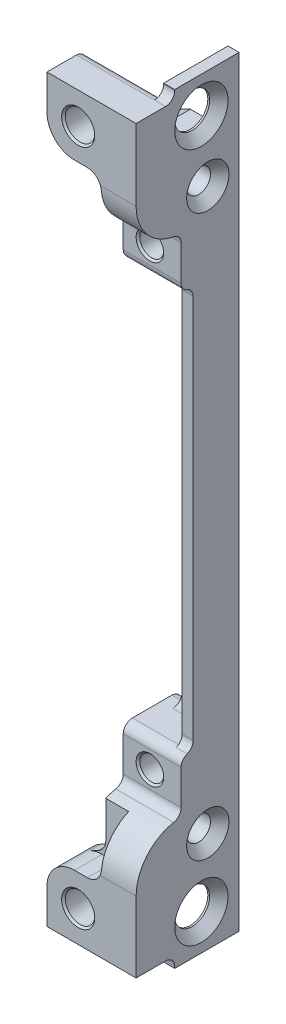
ISO-10303-21;
HEADER;
FILE_DESCRIPTION(('STEP AP214'),'2;1');
FILE_NAME('part.step','',(''),(''),'','','');
FILE_SCHEMA(('AUTOMOTIVE_DESIGN { 1 0 10303 214 1 1 1 1 }'));
ENDSEC;
DATA;
#1=APPLICATION_CONTEXT('core data for automotive mechanical design processes');
#2=APPLICATION_PROTOCOL_DEFINITION('international standard','automotive_design',2000,#1);
#3=PRODUCT_CONTEXT('',#1,'mechanical');
#4=PRODUCT('Part','Part','',(#3));
#5=PRODUCT_RELATED_PRODUCT_CATEGORY('part','',(#4));
#6=PRODUCT_DEFINITION_FORMATION('','',#4);
#7=PRODUCT_DEFINITION_CONTEXT('part definition',#1,'design');
#8=PRODUCT_DEFINITION('design','',#6,#7);
#9=PRODUCT_DEFINITION_SHAPE('','',#8);
#10=(LENGTH_UNIT() NAMED_UNIT(*) SI_UNIT(.MILLI.,.METRE.));
#11=(NAMED_UNIT(*) PLANE_ANGLE_UNIT() SI_UNIT($,.RADIAN.));
#12=(NAMED_UNIT(*) SI_UNIT($,.STERADIAN.) SOLID_ANGLE_UNIT());
#13=UNCERTAINTY_MEASURE_WITH_UNIT(LENGTH_MEASURE(1.E-05),#10,'distance_accuracy_value','');
#14=(GEOMETRIC_REPRESENTATION_CONTEXT(3) GLOBAL_UNCERTAINTY_ASSIGNED_CONTEXT((#13)) GLOBAL_UNIT_ASSIGNED_CONTEXT((#10,
#11,#12)) REPRESENTATION_CONTEXT('',''));
#15=CARTESIAN_POINT('',(0.,0.,0.));
#16=DIRECTION('',(0.,0.,1.));
#17=DIRECTION('',(1.,0.,0.));
#18=AXIS2_PLACEMENT_3D('',#15,#16,#17);
#19=CARTESIAN_POINT('',(-19.352148,20.6,2.2));
#20=DIRECTION('',(-1.,0.,0.));
#21=DIRECTION('',(0.,0.,1.));
#22=AXIS2_PLACEMENT_3D('',#19,#20,#21);
#23=CYLINDRICAL_SURFACE('',#22,1.);
#24=DIRECTION('',(1.,0.,0.));
#25=VECTOR('',#24,1.);
#26=CARTESIAN_POINT('',(-18.3,19.6,2.2));
#27=LINE('',#26,#25);
#28=CARTESIAN_POINT('',(-23.3,19.6,2.2));
#29=VERTEX_POINT('',#28);
#30=CARTESIAN_POINT('',(-19.5,19.6,2.2));
#31=VERTEX_POINT('',#30);
#32=EDGE_CURVE('E411',#29,#31,#27,.T.);
#33=ORIENTED_EDGE('',*,*,#32,.T.);
#34=CARTESIAN_POINT('',(-19.5,20.6,2.2));
#35=DIRECTION('',(-1.,0.,0.));
#36=DIRECTION('',(0.,0.,1.));
#37=AXIS2_PLACEMENT_3D('',#34,#35,#36);
#38=CIRCLE('',#37,1.);
#39=CARTESIAN_POINT('',(-19.5,20.6,1.2));
#40=VERTEX_POINT('',#39);
#41=EDGE_CURVE('E20',#40,#31,#38,.T.);
#42=ORIENTED_EDGE('',*,*,#41,.F.);
#43=DIRECTION('',(1.,0.,0.));
#44=VECTOR('',#43,1.);
#45=CARTESIAN_POINT('',(-21.45,20.6,1.2));
#46=LINE('',#45,#44);
#47=CARTESIAN_POINT('',(-23.3,20.6,1.2));
#48=VERTEX_POINT('',#47);
#49=EDGE_CURVE('E553',#48,#40,#46,.T.);
#50=ORIENTED_EDGE('',*,*,#49,.F.);
#51=CARTESIAN_POINT('',(-23.3,20.6,2.2));
#52=DIRECTION('',(-1.,0.,0.));
#53=DIRECTION('',(0.,0.,1.));
#54=AXIS2_PLACEMENT_3D('',#51,#52,#53);
#55=CIRCLE('',#54,1.);
#56=EDGE_CURVE('E409',#29,#48,#55,.F.);
#57=ORIENTED_EDGE('',*,*,#56,.F.);
#58=EDGE_LOOP('',(#33,#42,#50,#57));
#59=FACE_BOUND('',#58,.T.);
#60=ADVANCED_FACE('F17',(#59),#23,.F.);
#61=CARTESIAN_POINT('',(-24.733704,62.2,2.2));
#62=DIRECTION('',(1.,0.,0.));
#63=DIRECTION('',(0.,0.,-1.));
#64=AXIS2_PLACEMENT_3D('',#61,#62,#63);
#65=CYLINDRICAL_SURFACE('',#64,1.);
#66=DIRECTION('',(1.,0.,0.));
#67=VECTOR('',#66,1.);
#68=CARTESIAN_POINT('',(-21.45,62.2,1.2));
#69=LINE('',#68,#67);
#70=CARTESIAN_POINT('',(-19.5,62.2,1.2));
#71=VERTEX_POINT('',#70);
#72=CARTESIAN_POINT('',(-23.3,62.2,1.2));
#73=VERTEX_POINT('',#72);
#74=EDGE_CURVE('E415',#71,#73,#69,.F.);
#75=ORIENTED_EDGE('',*,*,#74,.F.);
#76=CARTESIAN_POINT('',(-19.5,62.2,2.2));
#77=DIRECTION('',(1.,0.,0.));
#78=DIRECTION('',(0.,0.,-1.));
#79=AXIS2_PLACEMENT_3D('',#76,#77,#78);
#80=CIRCLE('',#79,1.);
#81=CARTESIAN_POINT('',(-19.5,63.2,2.2));
#82=VERTEX_POINT('',#81);
#83=EDGE_CURVE('E993',#82,#71,#80,.F.);
#84=ORIENTED_EDGE('',*,*,#83,.F.);
#85=DIRECTION('',(1.,0.,0.));
#86=VECTOR('',#85,1.);
#87=CARTESIAN_POINT('',(-18.3,63.2,2.2));
#88=LINE('',#87,#86);
#89=CARTESIAN_POINT('',(-23.3,63.2,2.2));
#90=VERTEX_POINT('',#89);
#91=EDGE_CURVE('E499',#82,#90,#88,.F.);
#92=ORIENTED_EDGE('',*,*,#91,.T.);
#93=CARTESIAN_POINT('',(-23.3,62.2,2.2));
#94=DIRECTION('',(1.,0.,0.));
#95=DIRECTION('',(0.,0.,-1.));
#96=AXIS2_PLACEMENT_3D('',#93,#94,#95);
#97=CIRCLE('',#96,1.);
#98=EDGE_CURVE('E564',#73,#90,#97,.T.);
#99=ORIENTED_EDGE('',*,*,#98,.F.);
#100=EDGE_LOOP('',(#75,#84,#92,#99));
#101=FACE_BOUND('',#100,.T.);
#102=ADVANCED_FACE('F1750',(#101),#65,.F.);
#103=CARTESIAN_POINT('',(-25.40801491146,8.169151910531,8.2));
#104=DIRECTION('',(-0.461323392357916,0.887232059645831,0.));
#105=DIRECTION('',(-0.887232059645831,-0.461323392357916,0.));
#106=AXIS2_PLACEMENT_3D('',#103,#104,#105);
#107=PLANE('',#106);
#108=DIRECTION('',(0.,0.,1.));
#109=VECTOR('',#108,1.);
#110=CARTESIAN_POINT('',(-25.4080149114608,8.16915191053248,8.2));
#111=LINE('',#110,#109);
#112=CARTESIAN_POINT('',(-25.4080149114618,8.16915191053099,8.2));
#113=VERTEX_POINT('',#112);
#114=CARTESIAN_POINT('',(-25.4080149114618,8.16915191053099,7.));
#115=VERTEX_POINT('',#114);
#116=EDGE_CURVE('E414',#113,#115,#111,.F.);
#117=ORIENTED_EDGE('',*,*,#116,.T.);
#118=DIRECTION('',(0.887232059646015,0.461323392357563,0.));
#119=VECTOR('',#118,1.);
#120=CARTESIAN_POINT('',(-26.38397017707,7.661696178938,7.));
#121=LINE('',#120,#119);
#122=CARTESIAN_POINT('',(-26.3839701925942,7.66169617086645,7.));
#123=VERTEX_POINT('',#122);
#124=EDGE_CURVE('E509',#123,#115,#121,.T.);
#125=ORIENTED_EDGE('',*,*,#124,.F.);
#126=DIRECTION('',(0.,0.,-1.));
#127=VECTOR('',#126,1.);
#128=CARTESIAN_POINT('',(-26.3839702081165,7.66169616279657,12.35648));
#129=LINE('',#128,#127);
#130=CARTESIAN_POINT('',(-26.3839701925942,7.66169617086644,8.2));
#131=VERTEX_POINT('',#130);
#132=EDGE_CURVE('E565',#131,#123,#129,.T.);
#133=ORIENTED_EDGE('',*,*,#132,.F.);
#134=DIRECTION('',(0.887232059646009,0.461323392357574,0.));
#135=VECTOR('',#134,1.);
#136=CARTESIAN_POINT('',(-26.3839702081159,7.66169616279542,8.2));
#137=LINE('',#136,#135);
#138=EDGE_CURVE('E954',#131,#113,#137,.T.);
#139=ORIENTED_EDGE('',*,*,#138,.T.);
#140=EDGE_LOOP('',(#117,#125,#133,#139));
#141=FACE_BOUND('',#140,.T.);
#142=ADVANCED_FACE('F1429',(#141),#107,.T.);
#143=CARTESIAN_POINT('',(-28.,8.,5.1));
#144=DIRECTION('',(0.,-1.,0.));
#145=DIRECTION('',(0.,0.,-1.));
#146=AXIS2_PLACEMENT_3D('',#143,#144,#145);
#147=PLANE('',#146);
#148=DIRECTION('',(0.,0.,-1.));
#149=VECTOR('',#148,1.);
#150=CARTESIAN_POINT('',(-25.,8.,12.35648));
#151=LINE('',#150,#149);
#152=CARTESIAN_POINT('',(-25.,8.,11.2));
#153=VERTEX_POINT('',#152);
#154=CARTESIAN_POINT('',(-25.,8.,8.2));
#155=VERTEX_POINT('',#154);
#156=EDGE_CURVE('E939',#153,#155,#151,.T.);
#157=ORIENTED_EDGE('',*,*,#156,.F.);
#158=DIRECTION('',(1.,0.,0.));
#159=VECTOR('',#158,1.);
#160=CARTESIAN_POINT('',(-28.,8.,11.2));
#161=LINE('',#160,#159);
#162=CARTESIAN_POINT('',(-23.6,8.,11.2));
#163=VERTEX_POINT('',#162);
#164=EDGE_CURVE('E560',#163,#153,#161,.F.);
#165=ORIENTED_EDGE('',*,*,#164,.F.);
#166=DIRECTION('',(0.,0.,-1.));
#167=VECTOR('',#166,1.);
#168=CARTESIAN_POINT('',(-23.6,8.,11.35648));
#169=LINE('',#168,#167);
#170=CARTESIAN_POINT('',(-23.6,8.,8.2));
#171=VERTEX_POINT('',#170);
#172=EDGE_CURVE('E937',#163,#171,#169,.T.);
#173=ORIENTED_EDGE('',*,*,#172,.T.);
#174=DIRECTION('',(-1.,0.,0.));
#175=VECTOR('',#174,1.);
#176=CARTESIAN_POINT('',(-24.6,8.,8.2));
#177=LINE('',#176,#175);
#178=EDGE_CURVE('E947',#171,#155,#177,.T.);
#179=ORIENTED_EDGE('',*,*,#178,.T.);
#180=EDGE_LOOP('',(#157,#165,#173,#179));
#181=FACE_BOUND('',#180,.T.);
#182=ADVANCED_FACE('F1426',(#181),#147,.F.);
#183=CARTESIAN_POINT('',(-24.6,4.6,0.));
#184=DIRECTION('',(0.,0.,-1.));
#185=DIRECTION('',(-1.,0.,0.));
#186=AXIS2_PLACEMENT_3D('',#183,#184,#185);
#187=CYLINDRICAL_SURFACE('',#186,1.6);
#188=CARTESIAN_POINT('',(-24.6,4.6,8.69998004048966));
#189=DIRECTION('',(0.,0.,-1.));
#190=DIRECTION('',(0.,-1.,0.));
#191=AXIS2_PLACEMENT_3D('',#188,#189,#190);
#192=CIRCLE('',#191,1.6000000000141);
#193=CARTESIAN_POINT('',(-24.6,2.9999999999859,8.69998004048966));
#194=VERTEX_POINT('',#193);
#195=EDGE_CURVE('E555',#194,#194,#192,.T.);
#196=ORIENTED_EDGE('',*,*,#195,.T.);
#197=EDGE_LOOP('',(#196));
#198=FACE_BOUND('',#197,.T.);
#199=CARTESIAN_POINT('',(-24.6,4.6,11.0001295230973));
#200=DIRECTION('',(0.,0.,1.));
#201=DIRECTION('',(0.,-1.,0.));
#202=AXIS2_PLACEMENT_3D('',#199,#200,#201);
#203=CIRCLE('',#202,1.59999999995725);
#204=CARTESIAN_POINT('',(-24.6,3.00000000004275,11.0001295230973));
#205=VERTEX_POINT('',#204);
#206=EDGE_CURVE('E930',#205,#205,#203,.T.);
#207=ORIENTED_EDGE('',*,*,#206,.T.);
#208=EDGE_LOOP('',(#207));
#209=FACE_BOUND('',#208,.T.);
#210=ADVANCED_FACE('F804',(#198,#209),#187,.F.);
#211=CARTESIAN_POINT('',(-24.6,4.6,7.00000000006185));
#212=DIRECTION('',(0.,0.,-1.));
#213=DIRECTION('',(-1.,0.,0.));
#214=AXIS2_PLACEMENT_3D('',#211,#212,#213);
#215=CONICAL_SURFACE('',#214,3.29995883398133,0.785391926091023);
#216=ORIENTED_EDGE('',*,*,#195,.F.);
#217=EDGE_LOOP('',(#216));
#218=FACE_BOUND('',#217,.T.);
#219=CARTESIAN_POINT('',(-26.8648903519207,2.19999999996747,7.));
#220=CARTESIAN_POINT('',(-26.8336857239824,2.17059243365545,7.00003237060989));
#221=CARTESIAN_POINT('',(-26.8011216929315,2.1427520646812,7.00129637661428));
#222=CARTESIAN_POINT('',(-26.7339640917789,2.09000231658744,7.00570868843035));
#223=CARTESIAN_POINT('',(-26.6993769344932,2.06508435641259,7.00885130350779));
#224=CARTESIAN_POINT('',(-26.6290432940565,2.01805369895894,7.0164085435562));
#225=CARTESIAN_POINT('',(-26.5933130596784,1.99591397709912,7.02080928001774));
#226=CARTESIAN_POINT('',(-26.520647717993,1.95386108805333,7.03052514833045));
#227=CARTESIAN_POINT('',(-26.4837114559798,1.9339501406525,7.0358411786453));
#228=CARTESIAN_POINT('',(-26.3734097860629,1.87820458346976,7.05240674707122));
#229=CARTESIAN_POINT('',(-26.2987415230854,1.84519255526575,7.06449912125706));
#230=CARTESIAN_POINT('',(-26.1470321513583,1.78554732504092,7.08935926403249));
#231=CARTESIAN_POINT('',(-26.0699898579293,1.75891736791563,7.1021273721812));
#232=CARTESIAN_POINT('',(-25.9135280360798,1.71092107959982,7.12733611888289));
#233=CARTESIAN_POINT('',(-25.8340941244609,1.68960006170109,7.13977317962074));
#234=CARTESIAN_POINT('',(-25.6738825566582,1.65181906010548,7.16334540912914));
#235=CARTESIAN_POINT('',(-25.5931045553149,1.63536034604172,7.17448023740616));
#236=CARTESIAN_POINT('',(-25.3929633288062,1.60019947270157,7.19943551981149));
#237=CARTESIAN_POINT('',(-25.2730149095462,1.58397371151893,7.21212015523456));
#238=CARTESIAN_POINT('',(-25.0317906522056,1.55980349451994,7.23163298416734));
#239=CARTESIAN_POINT('',(-24.9105144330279,1.55186148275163,7.2384594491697));
#240=CARTESIAN_POINT('',(-24.6675572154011,1.54378103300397,7.24541009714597));
#241=CARTESIAN_POINT('',(-24.5458764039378,1.54363938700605,7.24553703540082));
#242=CARTESIAN_POINT('',(-24.3029552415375,1.55114031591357,7.23907523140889));
#243=CARTESIAN_POINT('',(-24.1817148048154,1.55878128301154,7.23248787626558));
#244=CARTESIAN_POINT('',(-23.9628293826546,1.5801443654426,7.21519066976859));
#245=CARTESIAN_POINT('',(-23.8649670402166,1.59248064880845,7.20546842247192));
#246=CARTESIAN_POINT('',(-23.6705522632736,1.6231549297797,7.18292340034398));
#247=CARTESIAN_POINT('',(-23.5739996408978,1.64149205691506,7.17010107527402));
#248=CARTESIAN_POINT('',(-23.3834487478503,1.68478449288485,7.14255841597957));
#249=CARTESIAN_POINT('',(-23.289436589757,1.70968811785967,7.12785334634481));
#250=CARTESIAN_POINT('',(-23.1038713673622,1.76730148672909,7.09787164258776));
#251=CARTESIAN_POINT('',(-23.0123180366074,1.80001038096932,7.08259507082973));
#252=CARTESIAN_POINT('',(-22.8698841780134,1.85945252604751,7.05947941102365));
#253=CARTESIAN_POINT('',(-22.8177904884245,1.88309354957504,7.05116969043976));
#254=CARTESIAN_POINT('',(-22.7153667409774,1.93407401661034,7.03563759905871));
#255=CARTESIAN_POINT('',(-22.6650339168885,1.96140729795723,7.02841345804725));
#256=CARTESIAN_POINT('',(-22.5660200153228,2.02075921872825,7.0157196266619));
#257=CARTESIAN_POINT('',(-22.5173683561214,2.05283339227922,7.01027359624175));
#258=CARTESIAN_POINT('',(-22.4468906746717,2.10484702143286,7.00438406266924));
#259=CARTESIAN_POINT('',(-22.4237580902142,2.12288713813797,7.00279968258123));
#260=CARTESIAN_POINT('',(-22.3785655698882,2.16037050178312,7.00061042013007));
#261=CARTESIAN_POINT('',(-22.3565070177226,2.17981548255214,7.00000677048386));
#262=CARTESIAN_POINT('',(-22.3351096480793,2.19999999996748,7.));
#263=B_SPLINE_CURVE_WITH_KNOTS('',3,(#219,#220,#221,#222,#223,#224,#225,#226,#227,#228,#229,
#230,#231,#232,#233,#234,#235,#236,#237,#238,#239,#240,#241,#242,#243,#244,#245,#246,#247,#248,
#249,#250,#251,#252,#253,#254,#255,#256,#257,#258,#259,#260,#261,#262),.UNSPECIFIED.,.F.,.F.,(4,
2,2,2,2,2,2,2,2,2,2,2,2,2,2,2,2,2,2,2,2,4),(0.,0.128445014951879,0.256502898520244,
0.383198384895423,0.510018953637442,0.757205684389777,1.00451782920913,1.25387358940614,
1.50329440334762,1.8679448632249,2.23270287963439,2.59731088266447,2.96184357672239,
3.25896606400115,3.55604547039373,3.85085301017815,4.14562847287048,4.31892758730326,
4.49194096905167,4.66717065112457,4.75524303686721,4.84342603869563),.UNSPECIFIED.);
#264=CARTESIAN_POINT('',(-26.8648903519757,2.19999999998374,6.99999999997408));
#265=VERTEX_POINT('',#264);
#266=CARTESIAN_POINT('',(-22.3351096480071,2.2,6.99999999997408));
#267=VERTEX_POINT('',#266);
#268=EDGE_CURVE('E808',#265,#267,#263,.T.);
#269=ORIENTED_EDGE('',*,*,#268,.F.);
#270=CARTESIAN_POINT('',(-24.6,4.6,6.99999999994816));
#271=DIRECTION('',(0.,0.,-1.));
#272=DIRECTION('',(-1.,0.,0.));
#273=AXIS2_PLACEMENT_3D('',#270,#271,#272);
#274=CIRCLE('',#273,3.29995883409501);
#275=EDGE_CURVE('E513',#267,#265,#274,.F.);
#276=ORIENTED_EDGE('',*,*,#275,.F.);
#277=EDGE_LOOP('',(#269,#276));
#278=FACE_BOUND('',#277,.T.);
#279=ADVANCED_FACE('F799',(#218,#278),#215,.F.);
#280=CARTESIAN_POINT('',(-21.45,41.4,1.2));
#281=DIRECTION('',(0.,0.,1.));
#282=DIRECTION('',(1.,0.,0.));
#283=AXIS2_PLACEMENT_3D('',#280,#281,#282);
#284=PLANE('',#283);
#285=DIRECTION('',(0.,1.,0.));
#286=VECTOR('',#285,1.);
#287=CARTESIAN_POINT('',(-19.5,19.6,1.2));
#288=LINE('',#287,#286);
#289=EDGE_CURVE('E408',#40,#71,#288,.T.);
#290=ORIENTED_EDGE('',*,*,#289,.T.);
#291=ORIENTED_EDGE('',*,*,#74,.T.);
#292=DIRECTION('',(0.,1.,0.));
#293=VECTOR('',#292,1.);
#294=CARTESIAN_POINT('',(-23.3,41.4,1.2));
#295=LINE('',#294,#293);
#296=EDGE_CURVE('E999',#48,#73,#295,.T.);
#297=ORIENTED_EDGE('',*,*,#296,.F.);
#298=ORIENTED_EDGE('',*,*,#49,.T.);
#299=EDGE_LOOP('',(#290,#291,#297,#298));
#300=FACE_BOUND('',#299,.T.);
#301=ADVANCED_FACE('F796',(#300),#284,.T.);
#302=CARTESIAN_POINT('',(-18.3,19.6,6.3));
#303=DIRECTION('',(0.,-1.,0.));
#304=DIRECTION('',(0.,0.,-1.));
#305=AXIS2_PLACEMENT_3D('',#302,#303,#304);
#306=PLANE('',#305);
#307=DIRECTION('',(0.,0.,-1.));
#308=VECTOR('',#307,1.);
#309=CARTESIAN_POINT('',(-24.6,19.6,0.));
#310=LINE('',#309,#308);
#311=CARTESIAN_POINT('',(-24.6,19.6,1.));
#312=VERTEX_POINT('',#311);
#313=CARTESIAN_POINT('',(-24.6,19.6,5.3));
#314=VERTEX_POINT('',#313);
#315=EDGE_CURVE('E1176',#312,#314,#310,.F.);
#316=ORIENTED_EDGE('',*,*,#315,.T.);
#317=DIRECTION('',(1.,0.,0.));
#318=VECTOR('',#317,1.);
#319=CARTESIAN_POINT('',(-24.733704,19.6,5.3));
#320=LINE('',#319,#318);
#321=CARTESIAN_POINT('',(-19.5,19.6,5.3));
#322=VERTEX_POINT('',#321);
#323=EDGE_CURVE('E419',#322,#314,#320,.F.);
#324=ORIENTED_EDGE('',*,*,#323,.F.);
#325=DIRECTION('',(0.,0.,-1.));
#326=VECTOR('',#325,1.);
#327=CARTESIAN_POINT('',(-19.5,19.6,5.));
#328=LINE('',#327,#326);
#329=EDGE_CURVE('E405',#322,#31,#328,.T.);
#330=ORIENTED_EDGE('',*,*,#329,.T.);
#331=ORIENTED_EDGE('',*,*,#32,.F.);
#332=DIRECTION('',(0.,0.,1.));
#333=VECTOR('',#332,1.);
#334=CARTESIAN_POINT('',(-23.3,19.6,3.856749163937));
#335=LINE('',#334,#333);
#336=CARTESIAN_POINT('',(-23.3,19.6,1.));
#337=VERTEX_POINT('',#336);
#338=EDGE_CURVE('E1001',#337,#29,#335,.T.);
#339=ORIENTED_EDGE('',*,*,#338,.F.);
#340=DIRECTION('',(1.,0.,0.));
#341=VECTOR('',#340,1.);
#342=CARTESIAN_POINT('',(-24.733704,19.6,1.));
#343=LINE('',#342,#341);
#344=EDGE_CURVE('E545',#312,#337,#343,.T.);
#345=ORIENTED_EDGE('',*,*,#344,.F.);
#346=EDGE_LOOP('',(#316,#324,#330,#331,#339,#345));
#347=FACE_BOUND('',#346,.T.);
#348=ADVANCED_FACE('F417',(#347),#306,.F.);
#349=CARTESIAN_POINT('',(-26.1,9.5,8.2));
#350=DIRECTION('',(0.,0.,1.));
#351=DIRECTION('',(1.,0.,0.));
#352=AXIS2_PLACEMENT_3D('',#349,#350,#351);
#353=CYLINDRICAL_SURFACE('',#352,1.5);
#354=CARTESIAN_POINT('',(-26.1,9.5,7.));
#355=DIRECTION('',(0.,0.,1.));
#356=DIRECTION('',(1.,0.,0.));
#357=AXIS2_PLACEMENT_3D('',#354,#355,#356);
#358=CIRCLE('',#357,1.5);
#359=CARTESIAN_POINT('',(-24.6,9.5,7.));
#360=VERTEX_POINT('',#359);
#361=EDGE_CURVE('E512',#115,#360,#358,.T.);
#362=ORIENTED_EDGE('',*,*,#361,.F.);
#363=ORIENTED_EDGE('',*,*,#116,.F.);
#364=CARTESIAN_POINT('',(-26.1,9.5,8.2));
#365=DIRECTION('',(0.,0.,1.));
#366=DIRECTION('',(1.,0.,0.));
#367=AXIS2_PLACEMENT_3D('',#364,#365,#366);
#368=CIRCLE('',#367,1.5);
#369=CARTESIAN_POINT('',(-24.6,9.5,8.2));
#370=VERTEX_POINT('',#369);
#371=EDGE_CURVE('E953',#113,#370,#368,.T.);
#372=ORIENTED_EDGE('',*,*,#371,.T.);
#373=DIRECTION('',(0.,0.,-1.));
#374=VECTOR('',#373,1.);
#375=CARTESIAN_POINT('',(-24.6,9.49999999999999,0.));
#376=LINE('',#375,#374);
#377=EDGE_CURVE('E528',#370,#360,#376,.T.);
#378=ORIENTED_EDGE('',*,*,#377,.T.);
#379=EDGE_LOOP('',(#362,#363,#372,#378));
#380=FACE_BOUND('',#379,.T.);
#381=ADVANCED_FACE('F789',(#380),#353,.F.);
#382=CARTESIAN_POINT('',(-24.1,8.25,3.5));
#383=DIRECTION('',(-0.447213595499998,-0.894427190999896,0.));
#384=DIRECTION('',(0.894427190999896,-0.447213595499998,0.));
#385=AXIS2_PLACEMENT_3D('',#382,#383,#384);
#386=PLANE('',#385);
#387=CARTESIAN_POINT('',(-21.6000000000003,7.,6.));
#388=DIRECTION('',(-0.447213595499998,-0.894427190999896,0.));
#389=DIRECTION('',(-0.894427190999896,0.447213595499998,0.));
#390=AXIS2_PLACEMENT_3D('',#387,#388,#389);
#391=ELLIPSE('',#390,2.23606797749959,1.);
#392=CARTESIAN_POINT('',(-23.6,8.,6.));
#393=VERTEX_POINT('',#392);
#394=CARTESIAN_POINT('',(-21.6000000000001,7.,7.));
#395=VERTEX_POINT('',#394);
#396=EDGE_CURVE('E539',#393,#395,#391,.F.);
#397=ORIENTED_EDGE('',*,*,#396,.T.);
#398=DIRECTION('',(0.894427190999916,-0.447213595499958,0.));
#399=VECTOR('',#398,1.);
#400=CARTESIAN_POINT('',(-24.6,8.5,7.));
#401=LINE('',#400,#399);
#402=CARTESIAN_POINT('',(-24.6,8.50000000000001,7.));
#403=VERTEX_POINT('',#402);
#404=EDGE_CURVE('E517',#403,#395,#401,.T.);
#405=ORIENTED_EDGE('',*,*,#404,.F.);
#406=DIRECTION('',(0.,0.,-1.));
#407=VECTOR('',#406,1.);
#408=CARTESIAN_POINT('',(-24.6,8.50000000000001,0.));
#409=LINE('',#408,#407);
#410=CARTESIAN_POINT('',(-24.6,8.50000000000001,0.));
#411=VERTEX_POINT('',#410);
#412=EDGE_CURVE('E548',#403,#411,#409,.T.);
#413=ORIENTED_EDGE('',*,*,#412,.T.);
#414=DIRECTION('',(0.894427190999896,-0.447213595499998,0.));
#415=VECTOR('',#414,1.);
#416=CARTESIAN_POINT('',(-24.1,8.25,0.));
#417=LINE('',#416,#415);
#418=CARTESIAN_POINT('',(-23.6,7.99999999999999,0.));
#419=VERTEX_POINT('',#418);
#420=EDGE_CURVE('E523',#411,#419,#417,.T.);
#421=ORIENTED_EDGE('',*,*,#420,.T.);
#422=DIRECTION('',(0.,0.,1.));
#423=VECTOR('',#422,1.);
#424=CARTESIAN_POINT('',(-23.6,8.,0.));
#425=LINE('',#424,#423);
#426=EDGE_CURVE('E522',#419,#393,#425,.T.);
#427=ORIENTED_EDGE('',*,*,#426,.T.);
#428=EDGE_LOOP('',(#397,#405,#413,#421,#427));
#429=FACE_BOUND('',#428,.T.);
#430=ADVANCED_FACE('F785',(#429),#386,.T.);
#431=CARTESIAN_POINT('',(-19.338816,7.,6.));
#432=DIRECTION('',(-1.,0.,0.));
#433=DIRECTION('',(0.,0.,1.));
#434=AXIS2_PLACEMENT_3D('',#431,#432,#433);
#435=CYLINDRICAL_SURFACE('',#434,1.);
#436=ORIENTED_EDGE('',*,*,#396,.F.);
#437=DIRECTION('',(1.,0.,0.));
#438=VECTOR('',#437,1.);
#439=CARTESIAN_POINT('',(-24.6,8.,6.));
#440=LINE('',#439,#438);
#441=CARTESIAN_POINT('',(-19.5,8.,6.));
#442=VERTEX_POINT('',#441);
#443=EDGE_CURVE('E518',#393,#442,#440,.T.);
#444=ORIENTED_EDGE('',*,*,#443,.T.);
#445=CARTESIAN_POINT('',(-19.5,7.,6.));
#446=DIRECTION('',(-1.,0.,0.));
#447=DIRECTION('',(0.,0.,1.));
#448=AXIS2_PLACEMENT_3D('',#445,#446,#447);
#449=CIRCLE('',#448,1.);
#450=CARTESIAN_POINT('',(-19.5,7.,7.));
#451=VERTEX_POINT('',#450);
#452=EDGE_CURVE('E525',#451,#442,#449,.T.);
#453=ORIENTED_EDGE('',*,*,#452,.F.);
#454=DIRECTION('',(-1.,0.,0.));
#455=VECTOR('',#454,1.);
#456=CARTESIAN_POINT('',(-23.15,7.,7.));
#457=LINE('',#456,#455);
#458=EDGE_CURVE('E514',#395,#451,#457,.F.);
#459=ORIENTED_EDGE('',*,*,#458,.F.);
#460=EDGE_LOOP('',(#436,#444,#453,#459));
#461=FACE_BOUND('',#460,.T.);
#462=ADVANCED_FACE('F781',(#461),#435,.F.);
#463=CARTESIAN_POINT('',(-23.15,41.4,7.));
#464=DIRECTION('',(0.,0.,-1.));
#465=DIRECTION('',(-1.,0.,0.));
#466=AXIS2_PLACEMENT_3D('',#463,#464,#465);
#467=PLANE('',#466);
#468=ORIENTED_EDGE('',*,*,#361,.T.);
#469=DIRECTION('',(0.,1.,0.));
#470=VECTOR('',#469,1.);
#471=CARTESIAN_POINT('',(-24.6,74.8,7.));
#472=LINE('',#471,#470);
#473=EDGE_CURVE('E530',#360,#403,#472,.F.);
#474=ORIENTED_EDGE('',*,*,#473,.T.);
#475=ORIENTED_EDGE('',*,*,#404,.T.);
#476=ORIENTED_EDGE('',*,*,#458,.T.);
#477=DIRECTION('',(0.,1.,0.));
#478=VECTOR('',#477,1.);
#479=CARTESIAN_POINT('',(-19.5,8.,7.));
#480=LINE('',#479,#478);
#481=CARTESIAN_POINT('',(-19.5,2.2,7.));
#482=VERTEX_POINT('',#481);
#483=EDGE_CURVE('E1160',#451,#482,#480,.F.);
#484=ORIENTED_EDGE('',*,*,#483,.T.);
#485=DIRECTION('',(-1.,0.,0.));
#486=VECTOR('',#485,1.);
#487=CARTESIAN_POINT('',(-28.,2.2,7.));
#488=LINE('',#487,#486);
#489=EDGE_CURVE('E816',#267,#482,#488,.F.);
#490=ORIENTED_EDGE('',*,*,#489,.F.);
#491=ORIENTED_EDGE('',*,*,#275,.T.);
#492=DIRECTION('',(-1.,0.,0.));
#493=VECTOR('',#492,1.);
#494=CARTESIAN_POINT('',(-28.,2.2,7.));
#495=LINE('',#494,#493);
#496=CARTESIAN_POINT('',(-28.,2.2,7.));
#497=VERTEX_POINT('',#496);
#498=EDGE_CURVE('E817',#497,#265,#495,.F.);
#499=ORIENTED_EDGE('',*,*,#498,.F.);
#500=DIRECTION('',(0.,1.,0.));
#501=VECTOR('',#500,1.);
#502=CARTESIAN_POINT('',(-28.,82.8,7.));
#503=LINE('',#502,#501);
#504=CARTESIAN_POINT('',(-28.,5.,7.));
#505=VERTEX_POINT('',#504);
#506=EDGE_CURVE('E922',#505,#497,#503,.F.);
#507=ORIENTED_EDGE('',*,*,#506,.F.);
#508=CARTESIAN_POINT('',(-25.,5.,7.));
#509=DIRECTION('',(0.,0.,-1.));
#510=DIRECTION('',(-1.,0.,0.));
#511=AXIS2_PLACEMENT_3D('',#508,#509,#510);
#512=CIRCLE('',#511,3.);
#513=EDGE_CURVE('E568',#123,#505,#512,.F.);
#514=ORIENTED_EDGE('',*,*,#513,.F.);
#515=ORIENTED_EDGE('',*,*,#124,.T.);
#516=EDGE_LOOP('',(#468,#474,#475,#476,#484,#490,#491,#499,#507,#514,#515));
#517=FACE_BOUND('',#516,.T.);
#518=ADVANCED_FACE('F777',(#517),#467,.T.);
#519=CARTESIAN_POINT('',(-23.818436,75.8,6.));
#520=DIRECTION('',(1.,0.,0.));
#521=DIRECTION('',(0.,0.,-1.));
#522=AXIS2_PLACEMENT_3D('',#519,#520,#521);
#523=CYLINDRICAL_SURFACE('',#522,1.);
#524=DIRECTION('',(1.,0.,0.));
#525=VECTOR('',#524,1.);
#526=CARTESIAN_POINT('',(-19.5,74.8,6.));
#527=LINE('',#526,#525);
#528=CARTESIAN_POINT('',(-19.5,74.8,6.));
#529=VERTEX_POINT('',#528);
#530=CARTESIAN_POINT('',(-23.6,74.8,6.));
#531=VERTEX_POINT('',#530);
#532=EDGE_CURVE('E469',#529,#531,#527,.F.);
#533=ORIENTED_EDGE('',*,*,#532,.T.);
#534=CARTESIAN_POINT('',(-21.6000000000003,75.8,6.));
#535=DIRECTION('',(-0.447213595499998,0.894427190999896,0.));
#536=DIRECTION('',(0.894427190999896,0.447213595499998,0.));
#537=AXIS2_PLACEMENT_3D('',#534,#535,#536);
#538=ELLIPSE('',#537,2.23606797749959,1.);
#539=CARTESIAN_POINT('',(-21.6000000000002,75.8,7.));
#540=VERTEX_POINT('',#539);
#541=EDGE_CURVE('E494',#540,#531,#538,.F.);
#542=ORIENTED_EDGE('',*,*,#541,.F.);
#543=DIRECTION('',(-1.,0.,0.));
#544=VECTOR('',#543,1.);
#545=CARTESIAN_POINT('',(-23.15,75.8,7.));
#546=LINE('',#545,#544);
#547=CARTESIAN_POINT('',(-19.5,75.8,7.));
#548=VERTEX_POINT('',#547);
#549=EDGE_CURVE('E474',#548,#540,#546,.T.);
#550=ORIENTED_EDGE('',*,*,#549,.F.);
#551=CARTESIAN_POINT('',(-19.5,75.8,6.));
#552=DIRECTION('',(1.,0.,0.));
#553=DIRECTION('',(0.,0.,-1.));
#554=AXIS2_PLACEMENT_3D('',#551,#552,#553);
#555=CIRCLE('',#554,1.);
#556=EDGE_CURVE('E552',#529,#548,#555,.F.);
#557=ORIENTED_EDGE('',*,*,#556,.F.);
#558=EDGE_LOOP('',(#533,#542,#550,#557));
#559=FACE_BOUND('',#558,.T.);
#560=ADVANCED_FACE('F773',(#559),#523,.F.);
#561=CARTESIAN_POINT('',(-26.1,73.4,8.2));
#562=DIRECTION('',(0.,0.,1.));
#563=DIRECTION('',(1.,0.,0.));
#564=AXIS2_PLACEMENT_3D('',#561,#562,#563);
#565=CYLINDRICAL_SURFACE('',#564,1.5);
#566=CARTESIAN_POINT('',(-26.1,73.4,8.2));
#567=DIRECTION('',(0.,0.,1.));
#568=DIRECTION('',(1.,0.,0.));
#569=AXIS2_PLACEMENT_3D('',#566,#567,#568);
#570=CIRCLE('',#569,1.5);
#571=CARTESIAN_POINT('',(-24.6,73.4,8.2));
#572=VERTEX_POINT('',#571);
#573=CARTESIAN_POINT('',(-25.4080149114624,74.7308480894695,8.2));
#574=VERTEX_POINT('',#573);
#575=EDGE_CURVE('E451',#572,#574,#570,.T.);
#576=ORIENTED_EDGE('',*,*,#575,.T.);
#577=DIRECTION('',(0.,0.,1.));
#578=VECTOR('',#577,1.);
#579=CARTESIAN_POINT('',(-25.4080149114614,74.7308480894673,8.2));
#580=LINE('',#579,#578);
#581=CARTESIAN_POINT('',(-25.4080149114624,74.7308480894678,7.));
#582=VERTEX_POINT('',#581);
#583=EDGE_CURVE('E459',#582,#574,#580,.T.);
#584=ORIENTED_EDGE('',*,*,#583,.F.);
#585=CARTESIAN_POINT('',(-26.1,73.4,7.));
#586=DIRECTION('',(0.,0.,1.));
#587=DIRECTION('',(1.,0.,0.));
#588=AXIS2_PLACEMENT_3D('',#585,#586,#587);
#589=CIRCLE('',#588,1.5);
#590=CARTESIAN_POINT('',(-24.6,73.4,7.));
#591=VERTEX_POINT('',#590);
#592=EDGE_CURVE('E468',#591,#582,#589,.T.);
#593=ORIENTED_EDGE('',*,*,#592,.F.);
#594=DIRECTION('',(0.,0.,-1.));
#595=VECTOR('',#594,1.);
#596=CARTESIAN_POINT('',(-24.6,73.4,0.));
#597=LINE('',#596,#595);
#598=EDGE_CURVE('E472',#591,#572,#597,.F.);
#599=ORIENTED_EDGE('',*,*,#598,.T.);
#600=EDGE_LOOP('',(#576,#584,#593,#599));
#601=FACE_BOUND('',#600,.T.);
#602=ADVANCED_FACE('F769',(#601),#565,.F.);
#603=CARTESIAN_POINT('',(-18.3,63.2,5.));
#604=DIRECTION('',(0.,1.,0.));
#605=DIRECTION('',(0.,0.,1.));
#606=AXIS2_PLACEMENT_3D('',#603,#604,#605);
#607=PLANE('',#606);
#608=DIRECTION('',(0.,0.,1.));
#609=VECTOR('',#608,1.);
#610=CARTESIAN_POINT('',(-23.3,63.2,3.856749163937));
#611=LINE('',#610,#609);
#612=CARTESIAN_POINT('',(-23.3,63.2,1.));
#613=VERTEX_POINT('',#612);
#614=EDGE_CURVE('E1003',#90,#613,#611,.F.);
#615=ORIENTED_EDGE('',*,*,#614,.F.);
#616=ORIENTED_EDGE('',*,*,#91,.F.);
#617=DIRECTION('',(0.,0.,-1.));
#618=VECTOR('',#617,1.);
#619=CARTESIAN_POINT('',(-19.5,63.2,5.));
#620=LINE('',#619,#618);
#621=CARTESIAN_POINT('',(-19.5,63.2,5.3));
#622=VERTEX_POINT('',#621);
#623=EDGE_CURVE('E423',#82,#622,#620,.F.);
#624=ORIENTED_EDGE('',*,*,#623,.T.);
#625=DIRECTION('',(1.,0.,0.));
#626=VECTOR('',#625,1.);
#627=CARTESIAN_POINT('',(-24.733704,63.2,5.3));
#628=LINE('',#627,#626);
#629=CARTESIAN_POINT('',(-24.6,63.2,5.3));
#630=VERTEX_POINT('',#629);
#631=EDGE_CURVE('E500',#630,#622,#628,.T.);
#632=ORIENTED_EDGE('',*,*,#631,.F.);
#633=DIRECTION('',(0.,0.,-1.));
#634=VECTOR('',#633,1.);
#635=CARTESIAN_POINT('',(-24.6,63.2,0.));
#636=LINE('',#635,#634);
#637=CARTESIAN_POINT('',(-24.6,63.2,1.));
#638=VERTEX_POINT('',#637);
#639=EDGE_CURVE('E1131',#630,#638,#636,.T.);
#640=ORIENTED_EDGE('',*,*,#639,.T.);
#641=DIRECTION('',(1.,0.,0.));
#642=VECTOR('',#641,1.);
#643=CARTESIAN_POINT('',(-18.3,63.2,1.));
#644=LINE('',#643,#642);
#645=EDGE_CURVE('E497',#613,#638,#644,.F.);
#646=ORIENTED_EDGE('',*,*,#645,.F.);
#647=EDGE_LOOP('',(#615,#616,#624,#632,#640,#646));
#648=FACE_BOUND('',#647,.T.);
#649=ADVANCED_FACE('F765',(#648),#607,.F.);
#650=CARTESIAN_POINT('',(-24.1,74.55,3.5));
#651=DIRECTION('',(-0.447213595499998,0.894427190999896,0.));
#652=DIRECTION('',(-0.894427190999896,-0.447213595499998,0.));
#653=AXIS2_PLACEMENT_3D('',#650,#651,#652);
#654=PLANE('',#653);
#655=DIRECTION('',(0.,0.,-1.));
#656=VECTOR('',#655,1.);
#657=CARTESIAN_POINT('',(-23.6,74.8,0.));
#658=LINE('',#657,#656);
#659=CARTESIAN_POINT('',(-23.6,74.8,0.));
#660=VERTEX_POINT('',#659);
#661=EDGE_CURVE('E473',#531,#660,#658,.T.);
#662=ORIENTED_EDGE('',*,*,#661,.T.);
#663=DIRECTION('',(-0.894427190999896,-0.447213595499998,0.));
#664=VECTOR('',#663,1.);
#665=CARTESIAN_POINT('',(-24.1,74.55,0.));
#666=LINE('',#665,#664);
#667=CARTESIAN_POINT('',(-24.6,74.3,0.));
#668=VERTEX_POINT('',#667);
#669=EDGE_CURVE('E492',#660,#668,#666,.T.);
#670=ORIENTED_EDGE('',*,*,#669,.T.);
#671=DIRECTION('',(0.,0.,-1.));
#672=VECTOR('',#671,1.);
#673=CARTESIAN_POINT('',(-24.6,74.3,0.));
#674=LINE('',#673,#672);
#675=CARTESIAN_POINT('',(-24.6,74.3,7.));
#676=VERTEX_POINT('',#675);
#677=EDGE_CURVE('E485',#668,#676,#674,.F.);
#678=ORIENTED_EDGE('',*,*,#677,.T.);
#679=DIRECTION('',(-0.894427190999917,-0.447213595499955,0.));
#680=VECTOR('',#679,1.);
#681=CARTESIAN_POINT('',(-21.6,75.8,7.));
#682=LINE('',#681,#680);
#683=EDGE_CURVE('E477',#540,#676,#682,.T.);
#684=ORIENTED_EDGE('',*,*,#683,.F.);
#685=ORIENTED_EDGE('',*,*,#541,.T.);
#686=EDGE_LOOP('',(#662,#670,#678,#684,#685));
#687=FACE_BOUND('',#686,.T.);
#688=ADVANCED_FACE('F761',(#687),#654,.T.);
#689=CARTESIAN_POINT('',(-21.7,66.1,0.));
#690=DIRECTION('',(0.,0.,-1.));
#691=DIRECTION('',(-1.,0.,0.));
#692=AXIS2_PLACEMENT_3D('',#689,#690,#691);
#693=CYLINDRICAL_SURFACE('',#692,1.3);
#694=CARTESIAN_POINT('',(-21.7,66.1,1.00016099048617));
#695=DIRECTION('',(0.,0.,-1.));
#696=DIRECTION('',(0.,-1.,0.));
#697=AXIS2_PLACEMENT_3D('',#694,#695,#696);
#698=CIRCLE('',#697,1.29999999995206);
#699=CARTESIAN_POINT('',(-21.7,64.8000000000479,1.00016099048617));
#700=VERTEX_POINT('',#699);
#701=EDGE_CURVE('E1123',#700,#700,#698,.T.);
#702=ORIENTED_EDGE('',*,*,#701,.T.);
#703=EDGE_LOOP('',(#702));
#704=FACE_BOUND('',#703,.T.);
#705=CARTESIAN_POINT('',(-21.7,66.1,6.10000016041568));
#706=DIRECTION('',(0.,0.,1.));
#707=DIRECTION('',(0.,-1.,0.));
#708=AXIS2_PLACEMENT_3D('',#705,#706,#707);
#709=CIRCLE('',#708,1.30000000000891);
#710=CARTESIAN_POINT('',(-21.7,64.7999999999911,6.10000016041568));
#711=VERTEX_POINT('',#710);
#712=EDGE_CURVE('E425',#711,#711,#709,.T.);
#713=ORIENTED_EDGE('',*,*,#712,.T.);
#714=EDGE_LOOP('',(#713));
#715=FACE_BOUND('',#714,.T.);
#716=ADVANCED_FACE('F757',(#704,#715),#693,.F.);
#717=CARTESIAN_POINT('',(-21.7,16.7,0.));
#718=DIRECTION('',(0.,0.,-1.));
#719=DIRECTION('',(-1.,0.,0.));
#720=AXIS2_PLACEMENT_3D('',#717,#718,#719);
#721=CYLINDRICAL_SURFACE('',#720,1.3);
#722=CARTESIAN_POINT('',(-21.7,16.7,1.00016099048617));
#723=DIRECTION('',(0.,0.,-1.));
#724=DIRECTION('',(0.,-1.,0.));
#725=AXIS2_PLACEMENT_3D('',#722,#723,#724);
#726=CIRCLE('',#725,1.30000000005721);
#727=CARTESIAN_POINT('',(-21.7,15.3999999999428,1.00016099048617));
#728=VERTEX_POINT('',#727);
#729=EDGE_CURVE('E1120',#728,#728,#726,.T.);
#730=ORIENTED_EDGE('',*,*,#729,.T.);
#731=EDGE_LOOP('',(#730));
#732=FACE_BOUND('',#731,.T.);
#733=CARTESIAN_POINT('',(-21.7,16.7,6.10000016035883));
#734=DIRECTION('',(0.,0.,1.));
#735=DIRECTION('',(0.,-1.,0.));
#736=AXIS2_PLACEMENT_3D('',#733,#734,#735);
#737=CIRCLE('',#736,1.29999999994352);
#738=CARTESIAN_POINT('',(-21.7,15.4000000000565,6.10000016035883));
#739=VERTEX_POINT('',#738);
#740=EDGE_CURVE('E957',#739,#739,#737,.T.);
#741=ORIENTED_EDGE('',*,*,#740,.T.);
#742=EDGE_LOOP('',(#741));
#743=FACE_BOUND('',#742,.T.);
#744=ADVANCED_FACE('F752',(#732,#743),#721,.F.);
#745=CARTESIAN_POINT('',(-24.6,78.3,7.00000000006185));
#746=DIRECTION('',(0.,0.,-1.));
#747=DIRECTION('',(-1.,0.,0.));
#748=AXIS2_PLACEMENT_3D('',#745,#746,#747);
#749=CONICAL_SURFACE('',#748,3.29995883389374,0.785391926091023);
#750=CARTESIAN_POINT('',(-24.6,78.3,8.69998004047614));
#751=DIRECTION('',(0.,0.,-1.));
#752=DIRECTION('',(-1.,0.,0.));
#753=AXIS2_PLACEMENT_3D('',#750,#751,#752);
#754=CIRCLE('',#753,1.6);
#755=CARTESIAN_POINT('',(-26.2,78.3,8.69998004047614));
#756=VERTEX_POINT('',#755);
#757=EDGE_CURVE('E452',#756,#756,#754,.F.);
#758=ORIENTED_EDGE('',*,*,#757,.T.);
#759=EDGE_LOOP('',(#758));
#760=FACE_BOUND('',#759,.T.);
#761=CARTESIAN_POINT('',(-22.3351096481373,80.6999999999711,7.00000000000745));
#762=CARTESIAN_POINT('',(-22.3663142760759,80.7294075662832,7.0000323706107));
#763=CARTESIAN_POINT('',(-22.3988783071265,80.7572479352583,7.00129637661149));
#764=CARTESIAN_POINT('',(-22.4660359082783,80.8099976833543,7.00570868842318));
#765=CARTESIAN_POINT('',(-22.5006230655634,80.8349156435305,7.00885130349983));
#766=CARTESIAN_POINT('',(-22.5709567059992,80.8819463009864,7.01640854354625));
#767=CARTESIAN_POINT('',(-22.606686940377,80.9040860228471,7.02080928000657));
#768=CARTESIAN_POINT('',(-22.679352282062,80.9461389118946,7.03052514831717));
#769=CARTESIAN_POINT('',(-22.716288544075,80.9660498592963,7.03584117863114));
#770=CARTESIAN_POINT('',(-22.8265902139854,81.0217954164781,7.05240674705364));
#771=CARTESIAN_POINT('',(-22.9012584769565,81.0548074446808,7.06449912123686));
#772=CARTESIAN_POINT('',(-23.0529678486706,81.1144526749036,7.0893592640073));
#773=CARTESIAN_POINT('',(-23.1300101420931,81.1410826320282,7.10212737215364));
#774=CARTESIAN_POINT('',(-23.2864719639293,81.1890789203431,7.12733611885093));
#775=CARTESIAN_POINT('',(-23.3659058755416,81.2103999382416,7.13977317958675));
#776=CARTESIAN_POINT('',(-23.5261174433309,81.2481809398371,7.16334540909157));
#777=CARTESIAN_POINT('',(-23.6068954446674,81.2646396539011,7.17448023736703));
#778=CARTESIAN_POINT('',(-23.8070366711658,81.2998005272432,7.19943551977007));
#779=CARTESIAN_POINT('',(-23.9269850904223,81.3160262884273,7.21212015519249));
#780=CARTESIAN_POINT('',(-24.168209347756,81.340196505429,7.23163298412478));
#781=CARTESIAN_POINT('',(-24.2894855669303,81.3481385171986,7.23845944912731));
#782=CARTESIAN_POINT('',(-24.5324427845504,81.3562189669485,7.24541009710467));
#783=CARTESIAN_POINT('',(-24.6541235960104,81.3563606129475,7.24553703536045));
#784=CARTESIAN_POINT('',(-24.8970447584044,81.348859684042,7.23907523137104));
#785=CARTESIAN_POINT('',(-25.0182851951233,81.341218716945,7.2324878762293));
#786=CARTESIAN_POINT('',(-25.2371706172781,81.3198556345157,7.21519066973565));
#787=CARTESIAN_POINT('',(-25.3350329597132,81.3075193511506,7.20546842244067));
#788=CARTESIAN_POINT('',(-25.5294477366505,81.2768450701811,7.18292340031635));
#789=CARTESIAN_POINT('',(-25.6260003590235,81.2585079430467,7.17010107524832));
#790=CARTESIAN_POINT('',(-25.8165512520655,81.2152155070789,7.14255841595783));
#791=CARTESIAN_POINT('',(-25.9105634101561,81.1903118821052,7.12785334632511));
#792=CARTESIAN_POINT('',(-26.0961286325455,81.1326985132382,7.09787164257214));
#793=CARTESIAN_POINT('',(-26.1876819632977,81.0999896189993,7.08259507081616));
#794=CARTESIAN_POINT('',(-26.3301158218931,81.0405474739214,7.05947941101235));
#795=CARTESIAN_POINT('',(-26.3822095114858,81.0169064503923,7.05116969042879));
#796=CARTESIAN_POINT('',(-26.4846332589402,80.9659259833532,7.0356375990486));
#797=CARTESIAN_POINT('',(-26.5349660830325,80.9385927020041,7.02841345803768));
#798=CARTESIAN_POINT('',(-26.6339799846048,80.8792407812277,7.0157196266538));
#799=CARTESIAN_POINT('',(-26.6826316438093,80.8471666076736,7.01027359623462));
#800=CARTESIAN_POINT('',(-26.7531093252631,80.7951529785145,7.00438406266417));
#801=CARTESIAN_POINT('',(-26.7762419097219,80.7771128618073,7.00279968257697));
#802=CARTESIAN_POINT('',(-26.82143443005,80.7396294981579,7.00061042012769));
#803=CARTESIAN_POINT('',(-26.8434929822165,80.7201845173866,7.00000677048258));
#804=CARTESIAN_POINT('',(-26.8648903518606,80.6999999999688,7.));
#805=B_SPLINE_CURVE_WITH_KNOTS('',3,(#761,#762,#763,#764,#765,#766,#767,#768,#769,#770,#771,
#772,#773,#774,#775,#776,#777,#778,#779,#780,#781,#782,#783,#784,#785,#786,#787,#788,#789,#790,
#791,#792,#793,#794,#795,#796,#797,#798,#799,#800,#801,#802,#803,#804),.UNSPECIFIED.,.F.,.F.,(4,
2,2,2,2,2,2,2,2,2,2,2,2,2,2,2,2,2,2,2,2,4),(0.,0.128445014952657,0.256502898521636,
0.383198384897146,0.510018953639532,0.757205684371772,1.00451782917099,1.25387358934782,
1.50329440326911,1.86794486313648,2.23270287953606,2.59731088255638,2.96184357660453,
3.25896606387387,3.55604547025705,3.85085301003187,4.14562847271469,4.31892758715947,
4.49194096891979,4.6671706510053,4.75524303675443,4.8434260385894),.UNSPECIFIED.);
#806=CARTESIAN_POINT('',(-22.3351096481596,80.6999999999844,7.0000000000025));
#807=VERTEX_POINT('',#806);
#808=CARTESIAN_POINT('',(-26.8648903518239,80.7,7.0000000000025));
#809=VERTEX_POINT('',#808);
#810=EDGE_CURVE('E732',#807,#809,#805,.T.);
#811=ORIENTED_EDGE('',*,*,#810,.F.);
#812=CARTESIAN_POINT('',(-24.6,78.3,7.000000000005));
#813=DIRECTION('',(0.,0.,-1.));
#814=DIRECTION('',(-1.,0.,0.));
#815=AXIS2_PLACEMENT_3D('',#812,#813,#814);
#816=CIRCLE('',#815,3.29995883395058);
#817=EDGE_CURVE('E478',#809,#807,#816,.F.);
#818=ORIENTED_EDGE('',*,*,#817,.F.);
#819=EDGE_LOOP('',(#811,#818));
#820=FACE_BOUND('',#819,.T.);
#821=ADVANCED_FACE('F746',(#760,#820),#749,.F.);
#822=CARTESIAN_POINT('',(-23.15,41.4,7.));
#823=DIRECTION('',(0.,0.,-1.));
#824=DIRECTION('',(-1.,0.,0.));
#825=AXIS2_PLACEMENT_3D('',#822,#823,#824);
#826=PLANE('',#825);
#827=ORIENTED_EDGE('',*,*,#592,.T.);
#828=DIRECTION('',(0.887232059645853,-0.461323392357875,0.));
#829=VECTOR('',#828,1.);
#830=CARTESIAN_POINT('',(-26.38397017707,75.23830382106,7.));
#831=LINE('',#830,#829);
#832=CARTESIAN_POINT('',(-26.3839701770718,75.2383038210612,7.));
#833=VERTEX_POINT('',#832);
#834=EDGE_CURVE('E465',#833,#582,#831,.T.);
#835=ORIENTED_EDGE('',*,*,#834,.F.);
#836=CARTESIAN_POINT('',(-25.,77.9,7.));
#837=DIRECTION('',(0.,0.,1.));
#838=DIRECTION('',(1.,0.,0.));
#839=AXIS2_PLACEMENT_3D('',#836,#837,#838);
#840=CIRCLE('',#839,3.);
#841=CARTESIAN_POINT('',(-28.,77.9,7.));
#842=VERTEX_POINT('',#841);
#843=EDGE_CURVE('E464',#842,#833,#840,.T.);
#844=ORIENTED_EDGE('',*,*,#843,.F.);
#845=DIRECTION('',(0.,1.,0.));
#846=VECTOR('',#845,1.);
#847=CARTESIAN_POINT('',(-28.,82.8,7.));
#848=LINE('',#847,#846);
#849=CARTESIAN_POINT('',(-28.,80.7,7.));
#850=VERTEX_POINT('',#849);
#851=EDGE_CURVE('E1080',#850,#842,#848,.F.);
#852=ORIENTED_EDGE('',*,*,#851,.F.);
#853=DIRECTION('',(-1.,0.,0.));
#854=VECTOR('',#853,1.);
#855=CARTESIAN_POINT('',(-28.,80.7,7.));
#856=LINE('',#855,#854);
#857=EDGE_CURVE('E740',#809,#850,#856,.T.);
#858=ORIENTED_EDGE('',*,*,#857,.F.);
#859=ORIENTED_EDGE('',*,*,#817,.T.);
#860=DIRECTION('',(-1.,0.,0.));
#861=VECTOR('',#860,1.);
#862=CARTESIAN_POINT('',(-28.,80.7,7.));
#863=LINE('',#862,#861);
#864=CARTESIAN_POINT('',(-19.5,80.7,7.));
#865=VERTEX_POINT('',#864);
#866=EDGE_CURVE('E741',#865,#807,#863,.T.);
#867=ORIENTED_EDGE('',*,*,#866,.F.);
#868=DIRECTION('',(0.,1.,0.));
#869=VECTOR('',#868,1.);
#870=CARTESIAN_POINT('',(-19.5,82.8,7.));
#871=LINE('',#870,#869);
#872=EDGE_CURVE('E1107',#865,#548,#871,.F.);
#873=ORIENTED_EDGE('',*,*,#872,.T.);
#874=ORIENTED_EDGE('',*,*,#549,.T.);
#875=ORIENTED_EDGE('',*,*,#683,.T.);
#876=DIRECTION('',(0.,1.,0.));
#877=VECTOR('',#876,1.);
#878=CARTESIAN_POINT('',(-24.6,74.8,7.));
#879=LINE('',#878,#877);
#880=EDGE_CURVE('E481',#676,#591,#879,.F.);
#881=ORIENTED_EDGE('',*,*,#880,.T.);
#882=EDGE_LOOP('',(#827,#835,#844,#852,#858,#859,#867,#873,#874,#875,#881));
#883=FACE_BOUND('',#882,.T.);
#884=ADVANCED_FACE('F751',(#883),#826,.T.);
#885=CARTESIAN_POINT('',(-26.38397017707,75.23830382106,8.2));
#886=DIRECTION('',(-0.461323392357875,-0.887232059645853,0.));
#887=DIRECTION('',(0.887232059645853,-0.461323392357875,0.));
#888=AXIS2_PLACEMENT_3D('',#885,#886,#887);
#889=PLANE('',#888);
#890=ORIENTED_EDGE('',*,*,#583,.T.);
#891=DIRECTION('',(-0.887232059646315,0.461323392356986,0.));
#892=VECTOR('',#891,1.);
#893=CARTESIAN_POINT('',(-25.40801491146,74.73084808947,8.2));
#894=LINE('',#893,#892);
#895=CARTESIAN_POINT('',(-26.38397017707,75.2383038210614,8.2));
#896=VERTEX_POINT('',#895);
#897=EDGE_CURVE('E449',#574,#896,#894,.T.);
#898=ORIENTED_EDGE('',*,*,#897,.T.);
#899=DIRECTION('',(0.,0.,1.));
#900=VECTOR('',#899,1.);
#901=CARTESIAN_POINT('',(-26.3839701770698,75.2383038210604,6.849196));
#902=LINE('',#901,#900);
#903=EDGE_CURVE('E460',#833,#896,#902,.T.);
#904=ORIENTED_EDGE('',*,*,#903,.F.);
#905=ORIENTED_EDGE('',*,*,#834,.T.);
#906=EDGE_LOOP('',(#890,#898,#904,#905));
#907=FACE_BOUND('',#906,.T.);
#908=ADVANCED_FACE('F1627',(#907),#889,.T.);
#909=CARTESIAN_POINT('',(-28.,74.9,13.8));
#910=DIRECTION('',(0.,1.,0.));
#911=DIRECTION('',(0.,0.,1.));
#912=AXIS2_PLACEMENT_3D('',#909,#910,#911);
#913=PLANE('',#912);
#914=DIRECTION('',(0.,0.,1.));
#915=VECTOR('',#914,1.);
#916=CARTESIAN_POINT('',(-23.6,74.9,8.049196));
#917=LINE('',#916,#915);
#918=CARTESIAN_POINT('',(-23.6,74.9,8.2));
#919=VERTEX_POINT('',#918);
#920=CARTESIAN_POINT('',(-23.6,74.9,11.2));
#921=VERTEX_POINT('',#920);
#922=EDGE_CURVE('E1066',#919,#921,#917,.T.);
#923=ORIENTED_EDGE('',*,*,#922,.T.);
#924=DIRECTION('',(1.,0.,0.));
#925=VECTOR('',#924,1.);
#926=CARTESIAN_POINT('',(-28.,74.9,11.2));
#927=LINE('',#926,#925);
#928=CARTESIAN_POINT('',(-25.,74.9,11.2));
#929=VERTEX_POINT('',#928);
#930=EDGE_CURVE('E455',#929,#921,#927,.T.);
#931=ORIENTED_EDGE('',*,*,#930,.F.);
#932=DIRECTION('',(0.,0.,1.));
#933=VECTOR('',#932,1.);
#934=CARTESIAN_POINT('',(-25.,74.9,6.849196));
#935=LINE('',#934,#933);
#936=CARTESIAN_POINT('',(-25.,74.9,8.2));
#937=VERTEX_POINT('',#936);
#938=EDGE_CURVE('E1073',#937,#929,#935,.T.);
#939=ORIENTED_EDGE('',*,*,#938,.F.);
#940=DIRECTION('',(-1.,0.,0.));
#941=VECTOR('',#940,1.);
#942=CARTESIAN_POINT('',(-24.6,74.9,8.2));
#943=LINE('',#942,#941);
#944=EDGE_CURVE('E447',#937,#919,#943,.F.);
#945=ORIENTED_EDGE('',*,*,#944,.T.);
#946=EDGE_LOOP('',(#923,#931,#939,#945));
#947=FACE_BOUND('',#946,.T.);
#948=ADVANCED_FACE('F1351',(#947),#913,.F.);
#949=CARTESIAN_POINT('',(-24.6,78.3,0.));
#950=DIRECTION('',(0.,0.,-1.));
#951=DIRECTION('',(-1.,0.,0.));
#952=AXIS2_PLACEMENT_3D('',#949,#950,#951);
#953=CYLINDRICAL_SURFACE('',#952,1.6);
#954=ORIENTED_EDGE('',*,*,#757,.F.);
#955=EDGE_LOOP('',(#954));
#956=FACE_BOUND('',#955,.T.);
#957=CARTESIAN_POINT('',(-24.6,78.3,11.0001295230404));
#958=DIRECTION('',(0.,0.,1.));
#959=DIRECTION('',(0.,-1.,0.));
#960=AXIS2_PLACEMENT_3D('',#957,#958,#959);
#961=CIRCLE('',#960,1.60000000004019);
#962=CARTESIAN_POINT('',(-24.6,76.6999999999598,11.0001295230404));
#963=VERTEX_POINT('',#962);
#964=EDGE_CURVE('E1062',#963,#963,#961,.T.);
#965=ORIENTED_EDGE('',*,*,#964,.T.);
#966=EDGE_LOOP('',(#965));
#967=FACE_BOUND('',#966,.T.);
#968=ADVANCED_FACE('F1608',(#956,#967),#953,.F.);
#969=CARTESIAN_POINT('',(-24.6000000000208,10.9,3.4));
#970=DIRECTION('',(-1.,0.,0.));
#971=DIRECTION('',(0.,-1.,0.));
#972=AXIS2_PLACEMENT_3D('',#969,#970,#971);
#973=CONICAL_SURFACE('',#972,1.49980492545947,0.785333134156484);
#974=CARTESIAN_POINT('',(-24.6000000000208,10.9,3.4));
#975=DIRECTION('',(-1.,0.,0.));
#976=DIRECTION('',(0.,-1.,0.));
#977=AXIS2_PLACEMENT_3D('',#974,#975,#976);
#978=CIRCLE('',#977,1.49980492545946);
#979=CARTESIAN_POINT('',(-24.6000000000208,9.40019507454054,3.4));
#980=VERTEX_POINT('',#979);
#981=EDGE_CURVE('E534',#980,#980,#978,.T.);
#982=ORIENTED_EDGE('',*,*,#981,.T.);
#983=EDGE_LOOP('',(#982));
#984=FACE_BOUND('',#983,.T.);
#985=CARTESIAN_POINT('',(-24.4001690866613,10.9,3.4));
#986=DIRECTION('',(1.,0.,0.));
#987=DIRECTION('',(0.,0.,-1.));
#988=AXIS2_PLACEMENT_3D('',#985,#986,#987);
#989=CIRCLE('',#988,1.3);
#990=CARTESIAN_POINT('',(-24.4001690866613,10.9,2.1));
#991=VERTEX_POINT('',#990);
#992=EDGE_CURVE('E1054',#991,#991,#989,.T.);
#993=ORIENTED_EDGE('',*,*,#992,.T.);
#994=EDGE_LOOP('',(#993));
#995=FACE_BOUND('',#994,.T.);
#996=ADVANCED_FACE('F1598',(#984,#995),#973,.F.);
#997=CARTESIAN_POINT('',(-24.6000000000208,71.9,3.4));
#998=DIRECTION('',(-1.,0.,0.));
#999=DIRECTION('',(0.,-1.,0.));
#1000=AXIS2_PLACEMENT_3D('',#997,#998,#999);
#1001=CONICAL_SURFACE('',#1000,1.49980492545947,0.785333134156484);
#1002=CARTESIAN_POINT('',(-24.6000000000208,71.9,3.4));
#1003=DIRECTION('',(-1.,0.,0.));
#1004=DIRECTION('',(0.,-1.,0.));
#1005=AXIS2_PLACEMENT_3D('',#1002,#1003,#1004);
#1006=CIRCLE('',#1005,1.49980492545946);
#1007=CARTESIAN_POINT('',(-24.6000000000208,70.4001950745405,3.4));
#1008=VERTEX_POINT('',#1007);
#1009=EDGE_CURVE('E484',#1008,#1008,#1006,.T.);
#1010=ORIENTED_EDGE('',*,*,#1009,.T.);
#1011=EDGE_LOOP('',(#1010));
#1012=FACE_BOUND('',#1011,.T.);
#1013=CARTESIAN_POINT('',(-24.4001690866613,71.9,3.4));
#1014=DIRECTION('',(1.,0.,0.));
#1015=DIRECTION('',(0.,0.,-1.));
#1016=AXIS2_PLACEMENT_3D('',#1013,#1014,#1015);
#1017=CIRCLE('',#1016,1.3);
#1018=CARTESIAN_POINT('',(-24.4001690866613,71.9,2.1));
#1019=VERTEX_POINT('',#1018);
#1020=EDGE_CURVE('E1051',#1019,#1019,#1017,.T.);
#1021=ORIENTED_EDGE('',*,*,#1020,.T.);
#1022=EDGE_LOOP('',(#1021));
#1023=FACE_BOUND('',#1022,.T.);
#1024=ADVANCED_FACE('F1588',(#1012,#1023),#1001,.F.);
#1025=CARTESIAN_POINT('',(-22.1,41.4,4.9));
#1026=DIRECTION('',(-1.,0.,0.));
#1027=DIRECTION('',(0.,0.,1.));
#1028=AXIS2_PLACEMENT_3D('',#1025,#1026,#1027);
#1029=PLANE('',#1028);
#1030=CARTESIAN_POINT('',(-22.1,73.89830484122,6.2));
#1031=DIRECTION('',(-1.,0.,0.));
#1032=DIRECTION('',(0.,0.,1.));
#1033=AXIS2_PLACEMENT_3D('',#1030,#1031,#1032);
#1034=CIRCLE('',#1033,5.);
#1035=CARTESIAN_POINT('',(-22.1,73.4,11.1751072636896));
#1036=VERTEX_POINT('',#1035);
#1037=CARTESIAN_POINT('',(-22.1,69.3157291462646,8.20000000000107));
#1038=VERTEX_POINT('',#1037);
#1039=EDGE_CURVE('E443',#1036,#1038,#1034,.F.);
#1040=ORIENTED_EDGE('',*,*,#1039,.F.);
#1041=DIRECTION('',(0.,0.,1.));
#1042=VECTOR('',#1041,1.);
#1043=CARTESIAN_POINT('',(-22.1,73.4,8.049196));
#1044=LINE('',#1043,#1042);
#1045=CARTESIAN_POINT('',(-22.1,73.4,8.2));
#1046=VERTEX_POINT('',#1045);
#1047=EDGE_CURVE('E463',#1036,#1046,#1044,.F.);
#1048=ORIENTED_EDGE('',*,*,#1047,.T.);
#1049=DIRECTION('',(0.,1.,0.));
#1050=VECTOR('',#1049,1.);
#1051=CARTESIAN_POINT('',(-22.1,74.9,8.2));
#1052=LINE('',#1051,#1050);
#1053=EDGE_CURVE('E444',#1046,#1038,#1052,.F.);
#1054=ORIENTED_EDGE('',*,*,#1053,.T.);
#1055=EDGE_LOOP('',(#1040,#1048,#1054));
#1056=FACE_BOUND('',#1055,.T.);
#1057=ADVANCED_FACE('F1578',(#1056),#1029,.T.);
#1058=CARTESIAN_POINT('',(-24.6,74.9,8.2));
#1059=DIRECTION('',(0.,0.,-1.));
#1060=DIRECTION('',(-1.,0.,0.));
#1061=AXIS2_PLACEMENT_3D('',#1058,#1059,#1060);
#1062=PLANE('',#1061);
#1063=DIRECTION('',(-1.,0.,0.));
#1064=VECTOR('',#1063,1.);
#1065=CARTESIAN_POINT('',(-18.149196,69.3157291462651,8.20000000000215));
#1066=LINE('',#1065,#1064);
#1067=CARTESIAN_POINT('',(-24.6,69.3157291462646,8.20000000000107));
#1068=VERTEX_POINT('',#1067);
#1069=EDGE_CURVE('E439',#1038,#1068,#1066,.T.);
#1070=ORIENTED_EDGE('',*,*,#1069,.F.);
#1071=ORIENTED_EDGE('',*,*,#1053,.F.);
#1072=CARTESIAN_POINT('',(-23.6,73.4,8.2));
#1073=DIRECTION('',(0.,0.,1.));
#1074=DIRECTION('',(1.,0.,0.));
#1075=AXIS2_PLACEMENT_3D('',#1072,#1073,#1074);
#1076=CIRCLE('',#1075,1.5);
#1077=EDGE_CURVE('E1070',#1046,#919,#1076,.T.);
#1078=ORIENTED_EDGE('',*,*,#1077,.T.);
#1079=ORIENTED_EDGE('',*,*,#944,.F.);
#1080=CARTESIAN_POINT('',(-25.,77.9,8.2));
#1081=DIRECTION('',(0.,0.,1.));
#1082=DIRECTION('',(1.,0.,0.));
#1083=AXIS2_PLACEMENT_3D('',#1080,#1081,#1082);
#1084=CIRCLE('',#1083,3.);
#1085=EDGE_CURVE('E1077',#896,#937,#1084,.T.);
#1086=ORIENTED_EDGE('',*,*,#1085,.F.);
#1087=ORIENTED_EDGE('',*,*,#897,.F.);
#1088=ORIENTED_EDGE('',*,*,#575,.F.);
#1089=DIRECTION('',(0.,1.,0.));
#1090=VECTOR('',#1089,1.);
#1091=CARTESIAN_POINT('',(-24.6,74.8,8.2));
#1092=LINE('',#1091,#1090);
#1093=EDGE_CURVE('E480',#572,#1068,#1092,.F.);
#1094=ORIENTED_EDGE('',*,*,#1093,.T.);
#1095=EDGE_LOOP('',(#1070,#1071,#1078,#1079,#1086,#1087,#1088,#1094));
#1096=FACE_BOUND('',#1095,.T.);
#1097=ADVANCED_FACE('F1569',(#1096),#1062,.F.);
#1098=CARTESIAN_POINT('',(-24.733704,64.2,5.3));
#1099=DIRECTION('',(1.,0.,0.));
#1100=DIRECTION('',(0.,0.,-1.));
#1101=AXIS2_PLACEMENT_3D('',#1098,#1099,#1100);
#1102=CYLINDRICAL_SURFACE('',#1101,1.);
#1103=ORIENTED_EDGE('',*,*,#631,.T.);
#1104=CARTESIAN_POINT('',(-19.5,64.2,5.3));
#1105=DIRECTION('',(1.,0.,0.));
#1106=DIRECTION('',(0.,0.,-1.));
#1107=AXIS2_PLACEMENT_3D('',#1104,#1105,#1106);
#1108=CIRCLE('',#1107,1.);
#1109=CARTESIAN_POINT('',(-19.5,63.2632503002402,5.64999999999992));
#1110=VERTEX_POINT('',#1109);
#1111=EDGE_CURVE('E970',#622,#1110,#1108,.F.);
#1112=ORIENTED_EDGE('',*,*,#1111,.T.);
#1113=DIRECTION('',(1.,0.,0.));
#1114=VECTOR('',#1113,1.);
#1115=CARTESIAN_POINT('',(-24.733704,63.2632503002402,5.64999999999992));
#1116=LINE('',#1115,#1114);
#1117=CARTESIAN_POINT('',(-18.3,63.2632503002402,5.64999999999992));
#1118=VERTEX_POINT('',#1117);
#1119=EDGE_CURVE('E446',#1110,#1118,#1116,.T.);
#1120=ORIENTED_EDGE('',*,*,#1119,.T.);
#1121=CARTESIAN_POINT('',(-18.3,64.2,5.3));
#1122=DIRECTION('',(1.,0.,0.));
#1123=DIRECTION('',(0.,0.,-1.));
#1124=AXIS2_PLACEMENT_3D('',#1121,#1122,#1123);
#1125=CIRCLE('',#1124,1.);
#1126=CARTESIAN_POINT('',(-18.3,64.2,6.3));
#1127=VERTEX_POINT('',#1126);
#1128=EDGE_CURVE('E503',#1118,#1127,#1125,.F.);
#1129=ORIENTED_EDGE('',*,*,#1128,.T.);
#1130=DIRECTION('',(-1.,0.,0.));
#1131=VECTOR('',#1130,1.);
#1132=CARTESIAN_POINT('',(-18.3,64.2,6.3));
#1133=LINE('',#1132,#1131);
#1134=CARTESIAN_POINT('',(-24.6,64.2,6.3));
#1135=VERTEX_POINT('',#1134);
#1136=EDGE_CURVE('E438',#1127,#1135,#1133,.T.);
#1137=ORIENTED_EDGE('',*,*,#1136,.T.);
#1138=CARTESIAN_POINT('',(-24.6,64.2,5.3));
#1139=DIRECTION('',(1.,0.,0.));
#1140=DIRECTION('',(0.,0.,-1.));
#1141=AXIS2_PLACEMENT_3D('',#1138,#1139,#1140);
#1142=CIRCLE('',#1141,1.);
#1143=EDGE_CURVE('E1134',#1135,#630,#1142,.T.);
#1144=ORIENTED_EDGE('',*,*,#1143,.T.);
#1145=EDGE_LOOP('',(#1103,#1112,#1120,#1129,#1137,#1144));
#1146=FACE_BOUND('',#1145,.T.);
#1147=ADVANCED_FACE('F1366',(#1146),#1102,.T.);
#1148=CARTESIAN_POINT('',(-18.14352,68.,7.3));
#1149=DIRECTION('',(-1.,0.,0.));
#1150=DIRECTION('',(0.,0.,1.));
#1151=AXIS2_PLACEMENT_3D('',#1148,#1149,#1150);
#1152=CYLINDRICAL_SURFACE('',#1151,1.);
#1153=CARTESIAN_POINT('',(-24.6,68.,7.3));
#1154=DIRECTION('',(-1.,0.,0.));
#1155=DIRECTION('',(0.,0.,1.));
#1156=AXIS2_PLACEMENT_3D('',#1153,#1154,#1155);
#1157=CIRCLE('',#1156,1.);
#1158=CARTESIAN_POINT('',(-24.6,68.9830508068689,7.11666666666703));
#1159=VERTEX_POINT('',#1158);
#1160=CARTESIAN_POINT('',(-24.6,68.,6.3));
#1161=VERTEX_POINT('',#1160);
#1162=EDGE_CURVE('E1136',#1159,#1161,#1157,.T.);
#1163=ORIENTED_EDGE('',*,*,#1162,.T.);
#1164=DIRECTION('',(-1.,0.,0.));
#1165=VECTOR('',#1164,1.);
#1166=CARTESIAN_POINT('',(-18.3,68.,6.3));
#1167=LINE('',#1166,#1165);
#1168=CARTESIAN_POINT('',(-18.3,68.,6.3));
#1169=VERTEX_POINT('',#1168);
#1170=EDGE_CURVE('E437',#1161,#1169,#1167,.F.);
#1171=ORIENTED_EDGE('',*,*,#1170,.T.);
#1172=CARTESIAN_POINT('',(-18.3,68.,7.3));
#1173=DIRECTION('',(-1.,0.,0.));
#1174=DIRECTION('',(0.,0.,1.));
#1175=AXIS2_PLACEMENT_3D('',#1172,#1173,#1174);
#1176=CIRCLE('',#1175,1.);
#1177=CARTESIAN_POINT('',(-18.3,68.9830508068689,7.11666666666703));
#1178=VERTEX_POINT('',#1177);
#1179=EDGE_CURVE('E431',#1178,#1169,#1176,.T.);
#1180=ORIENTED_EDGE('',*,*,#1179,.F.);
#1181=DIRECTION('',(-1.,0.,0.));
#1182=VECTOR('',#1181,1.);
#1183=CARTESIAN_POINT('',(-18.149196,68.9830508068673,7.11666666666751));
#1184=LINE('',#1183,#1182);
#1185=EDGE_CURVE('E704',#1159,#1178,#1184,.F.);
#1186=ORIENTED_EDGE('',*,*,#1185,.F.);
#1187=EDGE_LOOP('',(#1163,#1171,#1180,#1186));
#1188=FACE_BOUND('',#1187,.T.);
#1189=ADVANCED_FACE('F1361',(#1188),#1152,.F.);
#1190=CARTESIAN_POINT('',(-21.7,66.1,6.29999999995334));
#1191=DIRECTION('',(0.,0.,1.));
#1192=DIRECTION('',(1.,0.,0.));
#1193=AXIS2_PLACEMENT_3D('',#1190,#1191,#1192);
#1194=CONICAL_SURFACE('',#1193,1.49999981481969,0.785398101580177);
#1195=ORIENTED_EDGE('',*,*,#712,.F.);
#1196=EDGE_LOOP('',(#1195));
#1197=FACE_BOUND('',#1196,.T.);
#1198=CARTESIAN_POINT('',(-21.7,66.1,6.30000000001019));
#1199=DIRECTION('',(0.,0.,1.));
#1200=DIRECTION('',(1.,0.,0.));
#1201=AXIS2_PLACEMENT_3D('',#1198,#1199,#1200);
#1202=CIRCLE('',#1201,1.49999981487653);
#1203=CARTESIAN_POINT('',(-20.2000001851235,66.1,6.30000000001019));
#1204=VERTEX_POINT('',#1203);
#1205=EDGE_CURVE('E705',#1204,#1204,#1202,.T.);
#1206=ORIENTED_EDGE('',*,*,#1205,.T.);
#1207=EDGE_LOOP('',(#1206));
#1208=FACE_BOUND('',#1207,.T.);
#1209=ADVANCED_FACE('F1543',(#1197,#1208),#1194,.F.);
#1210=CARTESIAN_POINT('',(-19.5,19.6,5.));
#1211=DIRECTION('',(1.,0.,0.));
#1212=DIRECTION('',(0.,0.,-1.));
#1213=AXIS2_PLACEMENT_3D('',#1210,#1211,#1212);
#1214=PLANE('',#1213);
#1215=CARTESIAN_POINT('',(-19.5,62.32650060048,6.));
#1216=DIRECTION('',(-1.,0.,0.));
#1217=DIRECTION('',(0.,0.,1.));
#1218=AXIS2_PLACEMENT_3D('',#1215,#1216,#1217);
#1219=CIRCLE('',#1218,1.);
#1220=CARTESIAN_POINT('',(-19.5,62.32650060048,5.));
#1221=VERTEX_POINT('',#1220);
#1222=EDGE_CURVE('E969',#1221,#1110,#1219,.F.);
#1223=ORIENTED_EDGE('',*,*,#1222,.T.);
#1224=ORIENTED_EDGE('',*,*,#1111,.F.);
#1225=ORIENTED_EDGE('',*,*,#623,.F.);
#1226=ORIENTED_EDGE('',*,*,#83,.T.);
#1227=ORIENTED_EDGE('',*,*,#289,.F.);
#1228=ORIENTED_EDGE('',*,*,#41,.T.);
#1229=ORIENTED_EDGE('',*,*,#329,.F.);
#1230=CARTESIAN_POINT('',(-19.5,18.6,5.3));
#1231=DIRECTION('',(1.,0.,0.));
#1232=DIRECTION('',(0.,0.,-1.));
#1233=AXIS2_PLACEMENT_3D('',#1230,#1231,#1232);
#1234=CIRCLE('',#1233,1.);
#1235=CARTESIAN_POINT('',(-19.5,19.5367496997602,5.65000000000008));
#1236=VERTEX_POINT('',#1235);
#1237=EDGE_CURVE('E544',#1236,#322,#1234,.F.);
#1238=ORIENTED_EDGE('',*,*,#1237,.F.);
#1239=CARTESIAN_POINT('',(-19.5,20.47349939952,6.));
#1240=DIRECTION('',(-1.,0.,0.));
#1241=DIRECTION('',(0.,0.,1.));
#1242=AXIS2_PLACEMENT_3D('',#1239,#1240,#1241);
#1243=CIRCLE('',#1242,1.);
#1244=CARTESIAN_POINT('',(-19.5,20.47349939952,5.));
#1245=VERTEX_POINT('',#1244);
#1246=EDGE_CURVE('E421',#1245,#1236,#1243,.T.);
#1247=ORIENTED_EDGE('',*,*,#1246,.F.);
#1248=DIRECTION('',(0.,1.,0.));
#1249=VECTOR('',#1248,1.);
#1250=CARTESIAN_POINT('',(-19.5,19.6,5.));
#1251=LINE('',#1250,#1249);
#1252=EDGE_CURVE('E967',#1245,#1221,#1251,.T.);
#1253=ORIENTED_EDGE('',*,*,#1252,.T.);
#1254=EDGE_LOOP('',(#1223,#1224,#1225,#1226,#1227,#1228,#1229,#1238,#1247,#1253));
#1255=FACE_BOUND('',#1254,.T.);
#1256=ADVANCED_FACE('F402',(#1255),#1214,.F.);
#1257=CARTESIAN_POINT('',(-24.733704,18.6,5.3));
#1258=DIRECTION('',(1.,0.,0.));
#1259=DIRECTION('',(0.,0.,-1.));
#1260=AXIS2_PLACEMENT_3D('',#1257,#1258,#1259);
#1261=CYLINDRICAL_SURFACE('',#1260,1.);
#1262=DIRECTION('',(-1.,0.,0.));
#1263=VECTOR('',#1262,1.);
#1264=CARTESIAN_POINT('',(-18.3,18.6,6.3));
#1265=LINE('',#1264,#1263);
#1266=CARTESIAN_POINT('',(-24.6,18.6,6.3));
#1267=VERTEX_POINT('',#1266);
#1268=CARTESIAN_POINT('',(-18.3,18.6,6.3));
#1269=VERTEX_POINT('',#1268);
#1270=EDGE_CURVE('E965',#1267,#1269,#1265,.F.);
#1271=ORIENTED_EDGE('',*,*,#1270,.T.);
#1272=CARTESIAN_POINT('',(-18.3,18.6,5.3));
#1273=DIRECTION('',(1.,0.,0.));
#1274=DIRECTION('',(0.,0.,-1.));
#1275=AXIS2_PLACEMENT_3D('',#1272,#1273,#1274);
#1276=CIRCLE('',#1275,1.);
#1277=CARTESIAN_POINT('',(-18.3,19.53674969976,5.65));
#1278=VERTEX_POINT('',#1277);
#1279=EDGE_CURVE('E543',#1269,#1278,#1276,.F.);
#1280=ORIENTED_EDGE('',*,*,#1279,.T.);
#1281=DIRECTION('',(-1.,0.,0.));
#1282=VECTOR('',#1281,1.);
#1283=CARTESIAN_POINT('',(-18.06264744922,19.5367496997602,5.65000000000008));
#1284=LINE('',#1283,#1282);
#1285=EDGE_CURVE('E1042',#1278,#1236,#1284,.T.);
#1286=ORIENTED_EDGE('',*,*,#1285,.T.);
#1287=ORIENTED_EDGE('',*,*,#1237,.T.);
#1288=ORIENTED_EDGE('',*,*,#323,.T.);
#1289=CARTESIAN_POINT('',(-24.6,18.6,5.3));
#1290=DIRECTION('',(1.,0.,0.));
#1291=DIRECTION('',(0.,0.,-1.));
#1292=AXIS2_PLACEMENT_3D('',#1289,#1290,#1291);
#1293=CIRCLE('',#1292,1.);
#1294=EDGE_CURVE('E1178',#314,#1267,#1293,.T.);
#1295=ORIENTED_EDGE('',*,*,#1294,.T.);
#1296=EDGE_LOOP('',(#1271,#1280,#1286,#1287,#1288,#1295));
#1297=FACE_BOUND('',#1296,.T.);
#1298=ADVANCED_FACE('F1408',(#1297),#1261,.T.);
#1299=CARTESIAN_POINT('',(-21.7,16.7,6.2999999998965));
#1300=DIRECTION('',(0.,0.,1.));
#1301=DIRECTION('',(1.,0.,0.));
#1302=AXIS2_PLACEMENT_3D('',#1299,#1300,#1301);
#1303=CONICAL_SURFACE('',#1302,1.49999981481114,0.785398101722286);
#1304=ORIENTED_EDGE('',*,*,#740,.F.);
#1305=EDGE_LOOP('',(#1304));
#1306=FACE_BOUND('',#1305,.T.);
#1307=CARTESIAN_POINT('',(-21.7,16.7,6.30000000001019));
#1308=DIRECTION('',(0.,0.,1.));
#1309=DIRECTION('',(1.,0.,0.));
#1310=AXIS2_PLACEMENT_3D('',#1307,#1308,#1309);
#1311=CIRCLE('',#1310,1.49999981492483);
#1312=CARTESIAN_POINT('',(-20.2000001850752,16.7,6.30000000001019));
#1313=VERTEX_POINT('',#1312);
#1314=EDGE_CURVE('E1035',#1313,#1313,#1311,.T.);
#1315=ORIENTED_EDGE('',*,*,#1314,.T.);
#1316=EDGE_LOOP('',(#1315));
#1317=FACE_BOUND('',#1316,.T.);
#1318=ADVANCED_FACE('F1517',(#1306,#1317),#1303,.F.);
#1319=CARTESIAN_POINT('',(-18.14352,14.8,7.3));
#1320=DIRECTION('',(-1.,0.,0.));
#1321=DIRECTION('',(0.,0.,1.));
#1322=AXIS2_PLACEMENT_3D('',#1319,#1320,#1321);
#1323=CYLINDRICAL_SURFACE('',#1322,1.);
#1324=CARTESIAN_POINT('',(-18.3,14.8,7.3));
#1325=DIRECTION('',(-1.,0.,0.));
#1326=DIRECTION('',(0.,0.,1.));
#1327=AXIS2_PLACEMENT_3D('',#1324,#1325,#1326);
#1328=CIRCLE('',#1327,1.);
#1329=CARTESIAN_POINT('',(-18.3,14.8,6.3));
#1330=VERTEX_POINT('',#1329);
#1331=CARTESIAN_POINT('',(-18.3,13.8169491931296,7.11666666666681));
#1332=VERTEX_POINT('',#1331);
#1333=EDGE_CURVE('E956',#1330,#1332,#1328,.T.);
#1334=ORIENTED_EDGE('',*,*,#1333,.F.);
#1335=DIRECTION('',(-1.,0.,0.));
#1336=VECTOR('',#1335,1.);
#1337=CARTESIAN_POINT('',(-18.3,14.8,6.3));
#1338=LINE('',#1337,#1336);
#1339=CARTESIAN_POINT('',(-24.6,14.8,6.3));
#1340=VERTEX_POINT('',#1339);
#1341=EDGE_CURVE('E1038',#1330,#1340,#1338,.T.);
#1342=ORIENTED_EDGE('',*,*,#1341,.T.);
#1343=CARTESIAN_POINT('',(-24.6,14.8,7.3));
#1344=DIRECTION('',(-1.,0.,0.));
#1345=DIRECTION('',(0.,0.,1.));
#1346=AXIS2_PLACEMENT_3D('',#1343,#1344,#1345);
#1347=CIRCLE('',#1346,1.);
#1348=CARTESIAN_POINT('',(-24.6,13.8169491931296,7.11666666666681));
#1349=VERTEX_POINT('',#1348);
#1350=EDGE_CURVE('E1175',#1340,#1349,#1347,.T.);
#1351=ORIENTED_EDGE('',*,*,#1350,.T.);
#1352=DIRECTION('',(1.,0.,0.));
#1353=VECTOR('',#1352,1.);
#1354=CARTESIAN_POINT('',(-24.75648,13.8169491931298,7.11666666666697));
#1355=LINE('',#1354,#1353);
#1356=EDGE_CURVE('E1032',#1332,#1349,#1355,.F.);
#1357=ORIENTED_EDGE('',*,*,#1356,.F.);
#1358=EDGE_LOOP('',(#1334,#1342,#1351,#1357));
#1359=FACE_BOUND('',#1358,.T.);
#1360=ADVANCED_FACE('F1403',(#1359),#1323,.F.);
#1361=CARTESIAN_POINT('',(-24.6,18.,8.2));
#1362=DIRECTION('',(0.,0.,-1.));
#1363=DIRECTION('',(-1.,0.,0.));
#1364=AXIS2_PLACEMENT_3D('',#1361,#1362,#1363);
#1365=PLANE('',#1364);
#1366=CARTESIAN_POINT('',(-23.6,9.5,8.2));
#1367=DIRECTION('',(0.,0.,-1.));
#1368=DIRECTION('',(-1.,0.,0.));
#1369=AXIS2_PLACEMENT_3D('',#1366,#1367,#1368);
#1370=CIRCLE('',#1369,1.5);
#1371=CARTESIAN_POINT('',(-22.1,9.5,8.2));
#1372=VERTEX_POINT('',#1371);
#1373=EDGE_CURVE('E820',#171,#1372,#1370,.F.);
#1374=ORIENTED_EDGE('',*,*,#1373,.T.);
#1375=DIRECTION('',(0.,1.,0.));
#1376=VECTOR('',#1375,1.);
#1377=CARTESIAN_POINT('',(-22.1,41.4,8.2));
#1378=LINE('',#1377,#1376);
#1379=CARTESIAN_POINT('',(-22.1,13.4842708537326,8.20000000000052));
#1380=VERTEX_POINT('',#1379);
#1381=EDGE_CURVE('E944',#1380,#1372,#1378,.F.);
#1382=ORIENTED_EDGE('',*,*,#1381,.F.);
#1383=DIRECTION('',(1.,0.,0.));
#1384=VECTOR('',#1383,1.);
#1385=CARTESIAN_POINT('',(-24.75648,13.4842708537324,8.20000000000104));
#1386=LINE('',#1385,#1384);
#1387=CARTESIAN_POINT('',(-24.6,13.4842708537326,8.20000000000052));
#1388=VERTEX_POINT('',#1387);
#1389=EDGE_CURVE('E948',#1388,#1380,#1386,.T.);
#1390=ORIENTED_EDGE('',*,*,#1389,.F.);
#1391=DIRECTION('',(0.,1.,0.));
#1392=VECTOR('',#1391,1.);
#1393=CARTESIAN_POINT('',(-24.6,74.8,8.2));
#1394=LINE('',#1393,#1392);
#1395=EDGE_CURVE('E531',#1388,#370,#1394,.F.);
#1396=ORIENTED_EDGE('',*,*,#1395,.T.);
#1397=ORIENTED_EDGE('',*,*,#371,.F.);
#1398=ORIENTED_EDGE('',*,*,#138,.F.);
#1399=CARTESIAN_POINT('',(-25.,5.,8.2));
#1400=DIRECTION('',(0.,0.,-1.));
#1401=DIRECTION('',(-1.,0.,0.));
#1402=AXIS2_PLACEMENT_3D('',#1399,#1400,#1401);
#1403=CIRCLE('',#1402,3.);
#1404=EDGE_CURVE('E569',#155,#131,#1403,.F.);
#1405=ORIENTED_EDGE('',*,*,#1404,.F.);
#1406=ORIENTED_EDGE('',*,*,#178,.F.);
#1407=EDGE_LOOP('',(#1374,#1382,#1390,#1396,#1397,#1398,#1405,#1406));
#1408=FACE_BOUND('',#1407,.T.);
#1409=ADVANCED_FACE('F1387',(#1408),#1365,.F.);
#1410=CARTESIAN_POINT('',(-22.1,41.4,4.9));
#1411=DIRECTION('',(-1.,0.,0.));
#1412=DIRECTION('',(0.,0.,1.));
#1413=AXIS2_PLACEMENT_3D('',#1410,#1411,#1412);
#1414=PLANE('',#1413);
#1415=DIRECTION('',(0.,0.,-1.));
#1416=VECTOR('',#1415,1.);
#1417=CARTESIAN_POINT('',(-22.1,9.5,11.35648));
#1418=LINE('',#1417,#1416);
#1419=CARTESIAN_POINT('',(-22.1,9.50000000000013,11.1640740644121));
#1420=VERTEX_POINT('',#1419);
#1421=EDGE_CURVE('E933',#1372,#1420,#1418,.F.);
#1422=ORIENTED_EDGE('',*,*,#1421,.T.);
#1423=CARTESIAN_POINT('',(-22.1,8.901695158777,6.2));
#1424=DIRECTION('',(1.,0.,0.));
#1425=DIRECTION('',(0.,0.,-1.));
#1426=AXIS2_PLACEMENT_3D('',#1423,#1424,#1425);
#1427=CIRCLE('',#1426,5.);
#1428=EDGE_CURVE('E654',#1380,#1420,#1427,.T.);
#1429=ORIENTED_EDGE('',*,*,#1428,.F.);
#1430=ORIENTED_EDGE('',*,*,#1381,.T.);
#1431=EDGE_LOOP('',(#1422,#1429,#1430));
#1432=FACE_BOUND('',#1431,.T.);
#1433=ADVANCED_FACE('F1393',(#1432),#1414,.T.);
#1434=CARTESIAN_POINT('',(-25.,5.,12.35648));
#1435=DIRECTION('',(0.,0.,-1.));
#1436=DIRECTION('',(-1.,0.,0.));
#1437=AXIS2_PLACEMENT_3D('',#1434,#1435,#1436);
#1438=CYLINDRICAL_SURFACE('',#1437,3.);
#1439=CARTESIAN_POINT('',(-25.,5.,11.2));
#1440=DIRECTION('',(0.,0.,-1.));
#1441=DIRECTION('',(-1.,0.,0.));
#1442=AXIS2_PLACEMENT_3D('',#1439,#1440,#1441);
#1443=CIRCLE('',#1442,3.);
#1444=CARTESIAN_POINT('',(-28.,5.,11.2));
#1445=VERTEX_POINT('',#1444);
#1446=EDGE_CURVE('E643',#153,#1445,#1443,.F.);
#1447=ORIENTED_EDGE('',*,*,#1446,.F.);
#1448=ORIENTED_EDGE('',*,*,#156,.T.);
#1449=ORIENTED_EDGE('',*,*,#1404,.T.);
#1450=ORIENTED_EDGE('',*,*,#132,.T.);
#1451=ORIENTED_EDGE('',*,*,#513,.T.);
#1452=DIRECTION('',(0.,0.,1.));
#1453=VECTOR('',#1452,1.);
#1454=CARTESIAN_POINT('',(-28.,5.,0.));
#1455=LINE('',#1454,#1453);
#1456=EDGE_CURVE('E925',#1445,#505,#1455,.F.);
#1457=ORIENTED_EDGE('',*,*,#1456,.F.);
#1458=EDGE_LOOP('',(#1447,#1448,#1449,#1450,#1451,#1457));
#1459=FACE_BOUND('',#1458,.T.);
#1460=ADVANCED_FACE('F836',(#1459),#1438,.T.);
#1461=CARTESIAN_POINT('',(-23.6,9.5,11.35648));
#1462=DIRECTION('',(0.,0.,-1.));
#1463=DIRECTION('',(-1.,0.,0.));
#1464=AXIS2_PLACEMENT_3D('',#1461,#1462,#1463);
#1465=CYLINDRICAL_SURFACE('',#1464,1.5);
#1466=ORIENTED_EDGE('',*,*,#1421,.F.);
#1467=ORIENTED_EDGE('',*,*,#1373,.F.);
#1468=ORIENTED_EDGE('',*,*,#172,.F.);
#1469=CARTESIAN_POINT('',(-23.6,9.5,11.2));
#1470=DIRECTION('',(0.,0.,-1.));
#1471=DIRECTION('',(-1.,0.,0.));
#1472=AXIS2_PLACEMENT_3D('',#1469,#1470,#1471);
#1473=CIRCLE('',#1472,1.5);
#1474=CARTESIAN_POINT('',(-22.224488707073,8.90169515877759,11.2));
#1475=VERTEX_POINT('',#1474);
#1476=EDGE_CURVE('E639',#1475,#163,#1473,.T.);
#1477=ORIENTED_EDGE('',*,*,#1476,.F.);
#1478=CARTESIAN_POINT('',(-22.1,9.50000000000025,11.1640740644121));
#1479=CARTESIAN_POINT('',(-22.1000018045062,9.45926626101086,11.1689855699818));
#1480=CARTESIAN_POINT('',(-22.1016611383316,9.41849928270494,11.1733876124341));
#1481=CARTESIAN_POINT('',(-22.1083092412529,9.33711807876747,11.1811723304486));
#1482=CARTESIAN_POINT('',(-22.1132997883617,9.29650394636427,11.184554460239));
#1483=CARTESIAN_POINT('',(-22.1330365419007,9.17680566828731,11.1930553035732));
#1484=CARTESIAN_POINT('',(-22.1525492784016,9.09831454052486,11.1967128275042));
#1485=CARTESIAN_POINT('',(-22.1850308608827,9.00167621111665,11.1990423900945));
#1486=CARTESIAN_POINT('',(-22.1922979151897,8.98150527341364,11.1994033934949));
#1487=CARTESIAN_POINT('',(-22.2077276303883,8.94139536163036,11.1998824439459));
#1488=CARTESIAN_POINT('',(-22.2158943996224,8.92145795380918,11.1999993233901));
#1489=CARTESIAN_POINT('',(-22.2244887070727,8.90169515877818,11.2));
#1490=B_SPLINE_CURVE_WITH_KNOTS('',3,(#1478,#1479,#1480,#1481,#1482,#1483,#1484,#1485,#1486,
#1487,#1488,#1489),.UNSPECIFIED.,.F.,.F.,(4,2,2,2,2,4),(0.,0.122992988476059,0.246051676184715,
0.487539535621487,0.551858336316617,0.616484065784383),.UNSPECIFIED.);
#1491=EDGE_CURVE('E647',#1420,#1475,#1490,.T.);
#1492=ORIENTED_EDGE('',*,*,#1491,.F.);
#1493=EDGE_LOOP('',(#1466,#1467,#1468,#1477,#1492));
#1494=FACE_BOUND('',#1493,.T.);
#1495=ADVANCED_FACE('F656',(#1494),#1465,.F.);
#1496=CARTESIAN_POINT('',(-24.6,4.6,11.2000000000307));
#1497=DIRECTION('',(0.,0.,1.));
#1498=DIRECTION('',(1.,0.,0.));
#1499=AXIS2_PLACEMENT_3D('',#1496,#1497,#1498);
#1500=CONICAL_SURFACE('',#1499,1.79985429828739,0.785357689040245);
#1501=CARTESIAN_POINT('',(-24.6,4.6,11.2000000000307));
#1502=DIRECTION('',(0.,0.,1.));
#1503=DIRECTION('',(1.,0.,0.));
#1504=AXIS2_PLACEMENT_3D('',#1501,#1502,#1503);
#1505=CIRCLE('',#1504,1.79985429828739);
#1506=CARTESIAN_POINT('',(-22.8001457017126,4.6,11.2000000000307));
#1507=VERTEX_POINT('',#1506);
#1508=EDGE_CURVE('E635',#1507,#1507,#1505,.F.);
#1509=ORIENTED_EDGE('',*,*,#1508,.F.);
#1510=EDGE_LOOP('',(#1509));
#1511=FACE_BOUND('',#1510,.T.);
#1512=ORIENTED_EDGE('',*,*,#206,.F.);
#1513=EDGE_LOOP('',(#1512));
#1514=FACE_BOUND('',#1513,.T.);
#1515=ADVANCED_FACE('F827',(#1511,#1514),#1500,.F.);
#1516=CARTESIAN_POINT('',(-28.,2.2,8.));
#1517=DIRECTION('',(-1.,0.,0.));
#1518=DIRECTION('',(0.,0.,1.));
#1519=AXIS2_PLACEMENT_3D('',#1516,#1517,#1518);
#1520=CYLINDRICAL_SURFACE('',#1519,1.);
#1521=ORIENTED_EDGE('',*,*,#489,.T.);
#1522=CARTESIAN_POINT('',(-19.5,2.2,8.));
#1523=DIRECTION('',(-1.,0.,0.));
#1524=DIRECTION('',(0.,0.,1.));
#1525=AXIS2_PLACEMENT_3D('',#1522,#1523,#1524);
#1526=CIRCLE('',#1525,1.);
#1527=CARTESIAN_POINT('',(-19.5,1.2,8.));
#1528=VERTEX_POINT('',#1527);
#1529=EDGE_CURVE('E506',#482,#1528,#1526,.T.);
#1530=ORIENTED_EDGE('',*,*,#1529,.T.);
#1531=DIRECTION('',(1.,0.,0.));
#1532=VECTOR('',#1531,1.);
#1533=CARTESIAN_POINT('',(-18.3,1.2,8.));
#1534=LINE('',#1533,#1532);
#1535=CARTESIAN_POINT('',(-28.,1.2,8.));
#1536=VERTEX_POINT('',#1535);
#1537=EDGE_CURVE('E638',#1528,#1536,#1534,.F.);
#1538=ORIENTED_EDGE('',*,*,#1537,.T.);
#1539=CARTESIAN_POINT('',(-28.,2.2,8.));
#1540=DIRECTION('',(-1.,0.,0.));
#1541=DIRECTION('',(0.,0.,1.));
#1542=AXIS2_PLACEMENT_3D('',#1539,#1540,#1541);
#1543=CIRCLE('',#1542,1.);
#1544=EDGE_CURVE('E818',#497,#1536,#1543,.T.);
#1545=ORIENTED_EDGE('',*,*,#1544,.F.);
#1546=ORIENTED_EDGE('',*,*,#498,.T.);
#1547=ORIENTED_EDGE('',*,*,#268,.T.);
#1548=EDGE_LOOP('',(#1521,#1530,#1538,#1545,#1546,#1547));
#1549=FACE_BOUND('',#1548,.T.);
#1550=ADVANCED_FACE('F822',(#1549),#1520,.T.);
#1551=CARTESIAN_POINT('',(-28.,82.8,0.));
#1552=DIRECTION('',(-1.,0.,0.));
#1553=DIRECTION('',(0.,0.,1.));
#1554=AXIS2_PLACEMENT_3D('',#1551,#1552,#1553);
#1555=PLANE('',#1554);
#1556=ORIENTED_EDGE('',*,*,#1544,.T.);
#1557=DIRECTION('',(0.,0.,1.));
#1558=VECTOR('',#1557,1.);
#1559=CARTESIAN_POINT('',(-28.,1.2,13.));
#1560=LINE('',#1559,#1558);
#1561=CARTESIAN_POINT('',(-28.,1.2,11.2));
#1562=VERTEX_POINT('',#1561);
#1563=EDGE_CURVE('E908',#1536,#1562,#1560,.T.);
#1564=ORIENTED_EDGE('',*,*,#1563,.T.);
#1565=DIRECTION('',(0.,1.,0.));
#1566=VECTOR('',#1565,1.);
#1567=CARTESIAN_POINT('',(-28.,75.35,11.2));
#1568=LINE('',#1567,#1566);
#1569=EDGE_CURVE('E646',#1445,#1562,#1568,.F.);
#1570=ORIENTED_EDGE('',*,*,#1569,.F.);
#1571=ORIENTED_EDGE('',*,*,#1456,.T.);
#1572=ORIENTED_EDGE('',*,*,#506,.T.);
#1573=EDGE_LOOP('',(#1556,#1564,#1570,#1571,#1572));
#1574=FACE_BOUND('',#1573,.T.);
#1575=ADVANCED_FACE('F826',(#1574),#1555,.T.);
#1576=CARTESIAN_POINT('',(-23.3,41.4,3.856749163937));
#1577=DIRECTION('',(-1.,0.,0.));
#1578=DIRECTION('',(0.,0.,1.));
#1579=AXIS2_PLACEMENT_3D('',#1576,#1577,#1578);
#1580=PLANE('',#1579);
#1581=ORIENTED_EDGE('',*,*,#614,.T.);
#1582=CARTESIAN_POINT('',(-23.3,64.2,1.));
#1583=DIRECTION('',(-1.,0.,0.));
#1584=DIRECTION('',(0.,0.,1.));
#1585=AXIS2_PLACEMENT_3D('',#1582,#1583,#1584);
#1586=CIRCLE('',#1585,1.);
#1587=CARTESIAN_POINT('',(-23.3,64.2,0.));
#1588=VERTEX_POINT('',#1587);
#1589=EDGE_CURVE('E1192',#1588,#613,#1586,.T.);
#1590=ORIENTED_EDGE('',*,*,#1589,.F.);
#1591=DIRECTION('',(0.,1.,0.));
#1592=VECTOR('',#1591,1.);
#1593=CARTESIAN_POINT('',(-23.3,0.,0.));
#1594=LINE('',#1593,#1592);
#1595=CARTESIAN_POINT('',(-23.3,18.6,0.));
#1596=VERTEX_POINT('',#1595);
#1597=EDGE_CURVE('E1152',#1588,#1596,#1594,.F.);
#1598=ORIENTED_EDGE('',*,*,#1597,.T.);
#1599=CARTESIAN_POINT('',(-23.3,18.6,1.));
#1600=DIRECTION('',(1.,0.,0.));
#1601=DIRECTION('',(0.,0.,-1.));
#1602=AXIS2_PLACEMENT_3D('',#1599,#1600,#1601);
#1603=CIRCLE('',#1602,1.);
#1604=EDGE_CURVE('E549',#337,#1596,#1603,.F.);
#1605=ORIENTED_EDGE('',*,*,#1604,.F.);
#1606=ORIENTED_EDGE('',*,*,#338,.T.);
#1607=ORIENTED_EDGE('',*,*,#56,.T.);
#1608=ORIENTED_EDGE('',*,*,#296,.T.);
#1609=ORIENTED_EDGE('',*,*,#98,.T.);
#1610=EDGE_LOOP('',(#1581,#1590,#1598,#1605,#1606,#1607,#1608,#1609));
#1611=FACE_BOUND('',#1610,.T.);
#1612=ADVANCED_FACE('F997',(#1611),#1580,.T.);
#1613=CARTESIAN_POINT('',(-24.733704,18.6,1.));
#1614=DIRECTION('',(1.,0.,0.));
#1615=DIRECTION('',(0.,0.,-1.));
#1616=AXIS2_PLACEMENT_3D('',#1613,#1614,#1615);
#1617=CYLINDRICAL_SURFACE('',#1616,1.);
#1618=CARTESIAN_POINT('',(-24.6,18.6,1.));
#1619=DIRECTION('',(1.,0.,0.));
#1620=DIRECTION('',(0.,0.,-1.));
#1621=AXIS2_PLACEMENT_3D('',#1618,#1619,#1620);
#1622=CIRCLE('',#1621,1.);
#1623=CARTESIAN_POINT('',(-24.6,18.6,0.));
#1624=VERTEX_POINT('',#1623);
#1625=EDGE_CURVE('E1179',#1624,#312,#1622,.T.);
#1626=ORIENTED_EDGE('',*,*,#1625,.T.);
#1627=ORIENTED_EDGE('',*,*,#344,.T.);
#1628=ORIENTED_EDGE('',*,*,#1604,.T.);
#1629=DIRECTION('',(1.,0.,0.));
#1630=VECTOR('',#1629,1.);
#1631=CARTESIAN_POINT('',(0.,18.6,0.));
#1632=LINE('',#1631,#1630);
#1633=EDGE_CURVE('E1180',#1596,#1624,#1632,.F.);
#1634=ORIENTED_EDGE('',*,*,#1633,.T.);
#1635=EDGE_LOOP('',(#1626,#1627,#1628,#1634));
#1636=FACE_BOUND('',#1635,.T.);
#1637=ADVANCED_FACE('F1198',(#1636),#1617,.T.);
#1638=CARTESIAN_POINT('',(-24.6,74.8,0.));
#1639=DIRECTION('',(1.,0.,0.));
#1640=DIRECTION('',(0.,0.,-1.));
#1641=AXIS2_PLACEMENT_3D('',#1638,#1639,#1640);
#1642=PLANE('',#1641);
#1643=ORIENTED_EDGE('',*,*,#981,.F.);
#1644=EDGE_LOOP('',(#1643));
#1645=FACE_BOUND('',#1644,.T.);
#1646=ORIENTED_EDGE('',*,*,#377,.F.);
#1647=ORIENTED_EDGE('',*,*,#1395,.F.);
#1648=CARTESIAN_POINT('',(-24.6,8.901695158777,6.2));
#1649=DIRECTION('',(1.,0.,0.));
#1650=DIRECTION('',(0.,0.,-1.));
#1651=AXIS2_PLACEMENT_3D('',#1648,#1649,#1650);
#1652=CIRCLE('',#1651,5.);
#1653=EDGE_CURVE('E951',#1349,#1388,#1652,.T.);
#1654=ORIENTED_EDGE('',*,*,#1653,.F.);
#1655=ORIENTED_EDGE('',*,*,#1350,.F.);
#1656=DIRECTION('',(0.,1.,0.));
#1657=VECTOR('',#1656,1.);
#1658=CARTESIAN_POINT('',(-24.6,13.8,6.3));
#1659=LINE('',#1658,#1657);
#1660=EDGE_CURVE('E962',#1340,#1267,#1659,.T.);
#1661=ORIENTED_EDGE('',*,*,#1660,.T.);
#1662=ORIENTED_EDGE('',*,*,#1294,.F.);
#1663=ORIENTED_EDGE('',*,*,#315,.F.);
#1664=ORIENTED_EDGE('',*,*,#1625,.F.);
#1665=DIRECTION('',(0.,1.,0.));
#1666=VECTOR('',#1665,1.);
#1667=CARTESIAN_POINT('',(-24.6,0.,0.));
#1668=LINE('',#1667,#1666);
#1669=EDGE_CURVE('E1167',#1624,#411,#1668,.F.);
#1670=ORIENTED_EDGE('',*,*,#1669,.T.);
#1671=ORIENTED_EDGE('',*,*,#412,.F.);
#1672=ORIENTED_EDGE('',*,*,#473,.F.);
#1673=EDGE_LOOP('',(#1646,#1647,#1654,#1655,#1661,#1662,#1663,#1664,#1670,#1671,#1672));
#1674=FACE_BOUND('',#1673,.T.);
#1675=ADVANCED_FACE('F1206',(#1645,#1674),#1642,.F.);
#1676=CARTESIAN_POINT('',(-24.6,8.,0.));
#1677=DIRECTION('',(0.,1.,0.));
#1678=DIRECTION('',(0.,0.,1.));
#1679=AXIS2_PLACEMENT_3D('',#1676,#1677,#1678);
#1680=PLANE('',#1679);
#1681=ORIENTED_EDGE('',*,*,#426,.F.);
#1682=DIRECTION('',(1.,0.,0.));
#1683=VECTOR('',#1682,1.);
#1684=CARTESIAN_POINT('',(0.,8.,0.));
#1685=LINE('',#1684,#1683);
#1686=CARTESIAN_POINT('',(-19.5,8.,0.));
#1687=VERTEX_POINT('',#1686);
#1688=EDGE_CURVE('E1157',#419,#1687,#1685,.T.);
#1689=ORIENTED_EDGE('',*,*,#1688,.T.);
#1690=DIRECTION('',(0.,0.,-1.));
#1691=VECTOR('',#1690,1.);
#1692=CARTESIAN_POINT('',(-19.5,8.,0.));
#1693=LINE('',#1692,#1691);
#1694=EDGE_CURVE('E521',#1687,#442,#1693,.F.);
#1695=ORIENTED_EDGE('',*,*,#1694,.T.);
#1696=ORIENTED_EDGE('',*,*,#443,.F.);
#1697=EDGE_LOOP('',(#1681,#1689,#1695,#1696));
#1698=FACE_BOUND('',#1697,.T.);
#1699=ADVANCED_FACE('F1446',(#1698),#1680,.F.);
#1700=CARTESIAN_POINT('',(-19.5,8.,0.));
#1701=DIRECTION('',(1.,0.,0.));
#1702=DIRECTION('',(0.,0.,-1.));
#1703=AXIS2_PLACEMENT_3D('',#1700,#1701,#1702);
#1704=PLANE('',#1703);
#1705=CARTESIAN_POINT('',(-19.5,3.9,4.1));
#1706=DIRECTION('',(1.,0.,0.));
#1707=DIRECTION('',(0.,0.,-1.));
#1708=AXIS2_PLACEMENT_3D('',#1705,#1706,#1707);
#1709=CIRCLE('',#1708,1.9);
#1710=CARTESIAN_POINT('',(-19.5,3.9,2.2));
#1711=VERTEX_POINT('',#1710);
#1712=EDGE_CURVE('E1059',#1711,#1711,#1709,.T.);
#1713=ORIENTED_EDGE('',*,*,#1712,.T.);
#1714=EDGE_LOOP('',(#1713));
#1715=FACE_BOUND('',#1714,.T.);
#1716=ORIENTED_EDGE('',*,*,#483,.F.);
#1717=ORIENTED_EDGE('',*,*,#452,.T.);
#1718=ORIENTED_EDGE('',*,*,#1694,.F.);
#1719=DIRECTION('',(0.,1.,0.));
#1720=VECTOR('',#1719,1.);
#1721=CARTESIAN_POINT('',(-19.5,0.,0.));
#1722=LINE('',#1721,#1720);
#1723=CARTESIAN_POINT('',(-19.5,0.,0.));
#1724=VERTEX_POINT('',#1723);
#1725=EDGE_CURVE('E1155',#1687,#1724,#1722,.F.);
#1726=ORIENTED_EDGE('',*,*,#1725,.T.);
#1727=DIRECTION('',(0.,0.,-1.));
#1728=VECTOR('',#1727,1.);
#1729=CARTESIAN_POINT('',(-19.5,0.,0.));
#1730=LINE('',#1729,#1728);
#1731=CARTESIAN_POINT('',(-19.5,0.,7.));
#1732=VERTEX_POINT('',#1731);
#1733=EDGE_CURVE('E1017',#1732,#1724,#1730,.T.);
#1734=ORIENTED_EDGE('',*,*,#1733,.F.);
#1735=DIRECTION('',(0.,1.,0.));
#1736=VECTOR('',#1735,1.);
#1737=CARTESIAN_POINT('',(-19.5,41.4,7.));
#1738=LINE('',#1737,#1736);
#1739=CARTESIAN_POINT('',(-19.5,0.199999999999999,7.));
#1740=VERTEX_POINT('',#1739);
#1741=EDGE_CURVE('E1009',#1740,#1732,#1738,.F.);
#1742=ORIENTED_EDGE('',*,*,#1741,.F.);
#1743=CARTESIAN_POINT('',(-19.5,0.2,8.));
#1744=DIRECTION('',(1.,0.,0.));
#1745=DIRECTION('',(0.,0.,-1.));
#1746=AXIS2_PLACEMENT_3D('',#1743,#1744,#1745);
#1747=CIRCLE('',#1746,1.);
#1748=EDGE_CURVE('E630',#1740,#1528,#1747,.T.);
#1749=ORIENTED_EDGE('',*,*,#1748,.T.);
#1750=ORIENTED_EDGE('',*,*,#1529,.F.);
#1751=EDGE_LOOP('',(#1716,#1717,#1718,#1726,#1734,#1742,#1749,#1750));
#1752=FACE_BOUND('',#1751,.T.);
#1753=ADVANCED_FACE('F1438',(#1715,#1752),#1704,.F.);
#1754=CARTESIAN_POINT('',(-19.5,74.8,0.));
#1755=DIRECTION('',(0.,-1.,0.));
#1756=DIRECTION('',(0.,0.,-1.));
#1757=AXIS2_PLACEMENT_3D('',#1754,#1755,#1756);
#1758=PLANE('',#1757);
#1759=DIRECTION('',(0.,0.,-1.));
#1760=VECTOR('',#1759,1.);
#1761=CARTESIAN_POINT('',(-19.5,74.8,0.));
#1762=LINE('',#1761,#1760);
#1763=CARTESIAN_POINT('',(-19.5,74.8,0.));
#1764=VERTEX_POINT('',#1763);
#1765=EDGE_CURVE('E1103',#529,#1764,#1762,.T.);
#1766=ORIENTED_EDGE('',*,*,#1765,.T.);
#1767=DIRECTION('',(1.,0.,0.));
#1768=VECTOR('',#1767,1.);
#1769=CARTESIAN_POINT('',(0.,74.8,0.));
#1770=LINE('',#1769,#1768);
#1771=EDGE_CURVE('E1116',#1764,#660,#1770,.F.);
#1772=ORIENTED_EDGE('',*,*,#1771,.T.);
#1773=ORIENTED_EDGE('',*,*,#661,.F.);
#1774=ORIENTED_EDGE('',*,*,#532,.F.);
#1775=EDGE_LOOP('',(#1766,#1772,#1773,#1774));
#1776=FACE_BOUND('',#1775,.T.);
#1777=ADVANCED_FACE('F1335',(#1776),#1758,.F.);
#1778=CARTESIAN_POINT('',(-24.6,74.8,0.));
#1779=DIRECTION('',(1.,0.,0.));
#1780=DIRECTION('',(0.,0.,-1.));
#1781=AXIS2_PLACEMENT_3D('',#1778,#1779,#1780);
#1782=PLANE('',#1781);
#1783=ORIENTED_EDGE('',*,*,#1009,.F.);
#1784=EDGE_LOOP('',(#1783));
#1785=FACE_BOUND('',#1784,.T.);
#1786=ORIENTED_EDGE('',*,*,#677,.F.);
#1787=DIRECTION('',(0.,1.,0.));
#1788=VECTOR('',#1787,1.);
#1789=CARTESIAN_POINT('',(-24.6,0.,0.));
#1790=LINE('',#1789,#1788);
#1791=CARTESIAN_POINT('',(-24.6,64.2,0.));
#1792=VERTEX_POINT('',#1791);
#1793=EDGE_CURVE('E1137',#668,#1792,#1790,.F.);
#1794=ORIENTED_EDGE('',*,*,#1793,.T.);
#1795=CARTESIAN_POINT('',(-24.6,64.2,1.));
#1796=DIRECTION('',(-1.,0.,0.));
#1797=DIRECTION('',(0.,0.,1.));
#1798=AXIS2_PLACEMENT_3D('',#1795,#1796,#1797);
#1799=CIRCLE('',#1798,1.);
#1800=EDGE_CURVE('E1128',#638,#1792,#1799,.F.);
#1801=ORIENTED_EDGE('',*,*,#1800,.F.);
#1802=ORIENTED_EDGE('',*,*,#639,.F.);
#1803=ORIENTED_EDGE('',*,*,#1143,.F.);
#1804=DIRECTION('',(0.,1.,0.));
#1805=VECTOR('',#1804,1.);
#1806=CARTESIAN_POINT('',(-24.6,63.2,6.3));
#1807=LINE('',#1806,#1805);
#1808=EDGE_CURVE('E434',#1135,#1161,#1807,.T.);
#1809=ORIENTED_EDGE('',*,*,#1808,.T.);
#1810=ORIENTED_EDGE('',*,*,#1162,.F.);
#1811=CARTESIAN_POINT('',(-24.6,73.89830484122,6.2));
#1812=DIRECTION('',(-1.,0.,0.));
#1813=DIRECTION('',(0.,0.,1.));
#1814=AXIS2_PLACEMENT_3D('',#1811,#1812,#1813);
#1815=CIRCLE('',#1814,5.);
#1816=EDGE_CURVE('E442',#1068,#1159,#1815,.F.);
#1817=ORIENTED_EDGE('',*,*,#1816,.F.);
#1818=ORIENTED_EDGE('',*,*,#1093,.F.);
#1819=ORIENTED_EDGE('',*,*,#598,.F.);
#1820=ORIENTED_EDGE('',*,*,#880,.F.);
#1821=EDGE_LOOP('',(#1786,#1794,#1801,#1802,#1803,#1809,#1810,#1817,#1818,#1819,#1820));
#1822=FACE_BOUND('',#1821,.T.);
#1823=ADVANCED_FACE('F1370',(#1785,#1822),#1782,.F.);
#1824=CARTESIAN_POINT('',(-19.269192,64.2,1.));
#1825=DIRECTION('',(-1.,0.,0.));
#1826=DIRECTION('',(0.,0.,1.));
#1827=AXIS2_PLACEMENT_3D('',#1824,#1825,#1826);
#1828=CYLINDRICAL_SURFACE('',#1827,1.);
#1829=ORIENTED_EDGE('',*,*,#1800,.T.);
#1830=DIRECTION('',(1.,0.,0.));
#1831=VECTOR('',#1830,1.);
#1832=CARTESIAN_POINT('',(0.,64.2,0.));
#1833=LINE('',#1832,#1831);
#1834=EDGE_CURVE('E629',#1792,#1588,#1833,.T.);
#1835=ORIENTED_EDGE('',*,*,#1834,.T.);
#1836=ORIENTED_EDGE('',*,*,#1589,.T.);
#1837=ORIENTED_EDGE('',*,*,#645,.T.);
#1838=EDGE_LOOP('',(#1829,#1835,#1836,#1837));
#1839=FACE_BOUND('',#1838,.T.);
#1840=ADVANCED_FACE('F1772',(#1839),#1828,.T.);
#1841=CARTESIAN_POINT('',(-21.7,66.1,0.));
#1842=DIRECTION('',(0.,0.,-1.));
#1843=DIRECTION('',(-1.,0.,0.));
#1844=AXIS2_PLACEMENT_3D('',#1841,#1842,#1843);
#1845=CONICAL_SURFACE('',#1844,2.30028486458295,0.785460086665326);
#1846=ORIENTED_EDGE('',*,*,#701,.F.);
#1847=EDGE_LOOP('',(#1846));
#1848=FACE_BOUND('',#1847,.T.);
#1849=CARTESIAN_POINT('',(-21.7,66.1,0.));
#1850=DIRECTION('',(0.,0.,-1.));
#1851=DIRECTION('',(-1.,0.,0.));
#1852=AXIS2_PLACEMENT_3D('',#1849,#1850,#1851);
#1853=CIRCLE('',#1852,2.30028486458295);
#1854=CARTESIAN_POINT('',(-24.0002848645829,66.1,0.));
#1855=VERTEX_POINT('',#1854);
#1856=EDGE_CURVE('E626',#1855,#1855,#1853,.T.);
#1857=ORIENTED_EDGE('',*,*,#1856,.T.);
#1858=EDGE_LOOP('',(#1857));
#1859=FACE_BOUND('',#1858,.T.);
#1860=ADVANCED_FACE('F1824',(#1848,#1859),#1845,.F.);
#1861=CARTESIAN_POINT('',(-21.7,16.7,0.));
#1862=DIRECTION('',(0.,0.,-1.));
#1863=DIRECTION('',(-1.,0.,0.));
#1864=AXIS2_PLACEMENT_3D('',#1861,#1862,#1863);
#1865=CONICAL_SURFACE('',#1864,2.30028486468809,0.785460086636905);
#1866=ORIENTED_EDGE('',*,*,#729,.F.);
#1867=EDGE_LOOP('',(#1866));
#1868=FACE_BOUND('',#1867,.T.);
#1869=CARTESIAN_POINT('',(-21.7,16.7,0.));
#1870=DIRECTION('',(0.,0.,-1.));
#1871=DIRECTION('',(-1.,0.,0.));
#1872=AXIS2_PLACEMENT_3D('',#1869,#1870,#1871);
#1873=CIRCLE('',#1872,2.30028486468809);
#1874=CARTESIAN_POINT('',(-24.0002848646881,16.7,0.));
#1875=VERTEX_POINT('',#1874);
#1876=EDGE_CURVE('E622',#1875,#1875,#1873,.T.);
#1877=ORIENTED_EDGE('',*,*,#1876,.T.);
#1878=EDGE_LOOP('',(#1877));
#1879=FACE_BOUND('',#1878,.T.);
#1880=ADVANCED_FACE('F1820',(#1868,#1879),#1865,.F.);
#1881=CARTESIAN_POINT('',(-19.5,82.8,0.));
#1882=DIRECTION('',(1.,0.,0.));
#1883=DIRECTION('',(0.,0.,-1.));
#1884=AXIS2_PLACEMENT_3D('',#1881,#1882,#1883);
#1885=PLANE('',#1884);
#1886=CARTESIAN_POINT('',(-19.5,78.9,4.1));
#1887=DIRECTION('',(1.,0.,0.));
#1888=DIRECTION('',(0.,0.,-1.));
#1889=AXIS2_PLACEMENT_3D('',#1886,#1887,#1888);
#1890=CIRCLE('',#1889,1.9);
#1891=CARTESIAN_POINT('',(-19.5,78.9,2.2));
#1892=VERTEX_POINT('',#1891);
#1893=EDGE_CURVE('E1065',#1892,#1892,#1890,.T.);
#1894=ORIENTED_EDGE('',*,*,#1893,.T.);
#1895=EDGE_LOOP('',(#1894));
#1896=FACE_BOUND('',#1895,.T.);
#1897=DIRECTION('',(0.,0.,1.));
#1898=VECTOR('',#1897,1.);
#1899=CARTESIAN_POINT('',(-19.5,82.8,0.));
#1900=LINE('',#1899,#1898);
#1901=CARTESIAN_POINT('',(-19.5,82.8,0.));
#1902=VERTEX_POINT('',#1901);
#1903=CARTESIAN_POINT('',(-19.5,82.8,7.));
#1904=VERTEX_POINT('',#1903);
#1905=EDGE_CURVE('E1095',#1902,#1904,#1900,.T.);
#1906=ORIENTED_EDGE('',*,*,#1905,.F.);
#1907=DIRECTION('',(0.,1.,0.));
#1908=VECTOR('',#1907,1.);
#1909=CARTESIAN_POINT('',(-19.5,0.,0.));
#1910=LINE('',#1909,#1908);
#1911=EDGE_CURVE('E1113',#1902,#1764,#1910,.F.);
#1912=ORIENTED_EDGE('',*,*,#1911,.T.);
#1913=ORIENTED_EDGE('',*,*,#1765,.F.);
#1914=ORIENTED_EDGE('',*,*,#556,.T.);
#1915=ORIENTED_EDGE('',*,*,#872,.F.);
#1916=CARTESIAN_POINT('',(-19.5,80.7,8.));
#1917=DIRECTION('',(-1.,0.,0.));
#1918=DIRECTION('',(0.,0.,1.));
#1919=AXIS2_PLACEMENT_3D('',#1916,#1917,#1918);
#1920=CIRCLE('',#1919,1.);
#1921=CARTESIAN_POINT('',(-19.5,81.7,8.));
#1922=VERTEX_POINT('',#1921);
#1923=EDGE_CURVE('E744',#1922,#865,#1920,.T.);
#1924=ORIENTED_EDGE('',*,*,#1923,.F.);
#1925=CARTESIAN_POINT('',(-19.5,82.7,8.));
#1926=DIRECTION('',(-1.,0.,0.));
#1927=DIRECTION('',(0.,0.,1.));
#1928=AXIS2_PLACEMENT_3D('',#1925,#1926,#1927);
#1929=CIRCLE('',#1928,1.);
#1930=CARTESIAN_POINT('',(-19.5,82.7,7.));
#1931=VERTEX_POINT('',#1930);
#1932=EDGE_CURVE('E1112',#1931,#1922,#1929,.T.);
#1933=ORIENTED_EDGE('',*,*,#1932,.F.);
#1934=DIRECTION('',(0.,1.,0.));
#1935=VECTOR('',#1934,1.);
#1936=CARTESIAN_POINT('',(-19.5,82.8,7.));
#1937=LINE('',#1936,#1935);
#1938=EDGE_CURVE('E1101',#1904,#1931,#1937,.F.);
#1939=ORIENTED_EDGE('',*,*,#1938,.F.);
#1940=EDGE_LOOP('',(#1906,#1912,#1913,#1914,#1915,#1924,#1933,#1939));
#1941=FACE_BOUND('',#1940,.T.);
#1942=ADVANCED_FACE('F728',(#1896,#1941),#1885,.F.);
#1943=CARTESIAN_POINT('',(-28.,80.7,8.));
#1944=DIRECTION('',(-1.,0.,0.));
#1945=DIRECTION('',(0.,0.,1.));
#1946=AXIS2_PLACEMENT_3D('',#1943,#1944,#1945);
#1947=CYLINDRICAL_SURFACE('',#1946,1.);
#1948=ORIENTED_EDGE('',*,*,#857,.T.);
#1949=CARTESIAN_POINT('',(-28.,80.7,8.));
#1950=DIRECTION('',(-1.,0.,0.));
#1951=DIRECTION('',(0.,0.,1.));
#1952=AXIS2_PLACEMENT_3D('',#1949,#1950,#1951);
#1953=CIRCLE('',#1952,1.);
#1954=CARTESIAN_POINT('',(-28.,81.7,8.));
#1955=VERTEX_POINT('',#1954);
#1956=EDGE_CURVE('E742',#1955,#850,#1953,.T.);
#1957=ORIENTED_EDGE('',*,*,#1956,.F.);
#1958=DIRECTION('',(1.,0.,0.));
#1959=VECTOR('',#1958,1.);
#1960=CARTESIAN_POINT('',(-28.,81.7,8.));
#1961=LINE('',#1960,#1959);
#1962=EDGE_CURVE('E1085',#1955,#1922,#1961,.T.);
#1963=ORIENTED_EDGE('',*,*,#1962,.T.);
#1964=ORIENTED_EDGE('',*,*,#1923,.T.);
#1965=ORIENTED_EDGE('',*,*,#866,.T.);
#1966=ORIENTED_EDGE('',*,*,#810,.T.);
#1967=EDGE_LOOP('',(#1948,#1957,#1963,#1964,#1965,#1966));
#1968=FACE_BOUND('',#1967,.T.);
#1969=ADVANCED_FACE('F723',(#1968),#1947,.T.);
#1970=CARTESIAN_POINT('',(-28.,82.8,0.));
#1971=DIRECTION('',(-1.,0.,0.));
#1972=DIRECTION('',(0.,0.,1.));
#1973=AXIS2_PLACEMENT_3D('',#1970,#1971,#1972);
#1974=PLANE('',#1973);
#1975=ORIENTED_EDGE('',*,*,#851,.T.);
#1976=DIRECTION('',(0.,0.,1.));
#1977=VECTOR('',#1976,1.);
#1978=CARTESIAN_POINT('',(-28.,77.9,6.849196));
#1979=LINE('',#1978,#1977);
#1980=CARTESIAN_POINT('',(-28.,77.9,11.2));
#1981=VERTEX_POINT('',#1980);
#1982=EDGE_CURVE('E1076',#1981,#842,#1979,.F.);
#1983=ORIENTED_EDGE('',*,*,#1982,.F.);
#1984=DIRECTION('',(0.,1.,0.));
#1985=VECTOR('',#1984,1.);
#1986=CARTESIAN_POINT('',(-28.,75.35,11.2));
#1987=LINE('',#1986,#1985);
#1988=CARTESIAN_POINT('',(-28.,81.7,11.2));
#1989=VERTEX_POINT('',#1988);
#1990=EDGE_CURVE('E621',#1989,#1981,#1987,.F.);
#1991=ORIENTED_EDGE('',*,*,#1990,.F.);
#1992=DIRECTION('',(0.,0.,-1.));
#1993=VECTOR('',#1992,1.);
#1994=CARTESIAN_POINT('',(-28.,81.7,13.));
#1995=LINE('',#1994,#1993);
#1996=EDGE_CURVE('E1082',#1989,#1955,#1995,.T.);
#1997=ORIENTED_EDGE('',*,*,#1996,.T.);
#1998=ORIENTED_EDGE('',*,*,#1956,.T.);
#1999=EDGE_LOOP('',(#1975,#1983,#1991,#1997,#1998));
#2000=FACE_BOUND('',#1999,.T.);
#2001=ADVANCED_FACE('F719',(#2000),#1974,.T.);
#2002=CARTESIAN_POINT('',(-25.,77.9,6.849196));
#2003=DIRECTION('',(0.,0.,1.));
#2004=DIRECTION('',(1.,0.,0.));
#2005=AXIS2_PLACEMENT_3D('',#2002,#2003,#2004);
#2006=CYLINDRICAL_SURFACE('',#2005,3.);
#2007=ORIENTED_EDGE('',*,*,#843,.T.);
#2008=ORIENTED_EDGE('',*,*,#903,.T.);
#2009=ORIENTED_EDGE('',*,*,#1085,.T.);
#2010=ORIENTED_EDGE('',*,*,#938,.T.);
#2011=CARTESIAN_POINT('',(-25.,77.9,11.2));
#2012=DIRECTION('',(0.,0.,1.));
#2013=DIRECTION('',(1.,0.,0.));
#2014=AXIS2_PLACEMENT_3D('',#2011,#2012,#2013);
#2015=CIRCLE('',#2014,3.);
#2016=EDGE_CURVE('E618',#1981,#929,#2015,.T.);
#2017=ORIENTED_EDGE('',*,*,#2016,.F.);
#2018=ORIENTED_EDGE('',*,*,#1982,.T.);
#2019=EDGE_LOOP('',(#2007,#2008,#2009,#2010,#2017,#2018));
#2020=FACE_BOUND('',#2019,.T.);
#2021=ADVANCED_FACE('F714',(#2020),#2006,.T.);
#2022=CARTESIAN_POINT('',(-23.6,73.4,8.049196));
#2023=DIRECTION('',(0.,0.,1.));
#2024=DIRECTION('',(1.,0.,0.));
#2025=AXIS2_PLACEMENT_3D('',#2022,#2023,#2024);
#2026=CYLINDRICAL_SURFACE('',#2025,1.5);
#2027=CARTESIAN_POINT('',(-23.6,73.4,11.2));
#2028=DIRECTION('',(0.,0.,1.));
#2029=DIRECTION('',(1.,0.,0.));
#2030=AXIS2_PLACEMENT_3D('',#2027,#2028,#2029);
#2031=CIRCLE('',#2030,1.5);
#2032=CARTESIAN_POINT('',(-22.1851882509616,73.8983048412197,11.2));
#2033=VERTEX_POINT('',#2032);
#2034=EDGE_CURVE('E615',#921,#2033,#2031,.F.);
#2035=ORIENTED_EDGE('',*,*,#2034,.F.);
#2036=ORIENTED_EDGE('',*,*,#922,.F.);
#2037=ORIENTED_EDGE('',*,*,#1077,.F.);
#2038=ORIENTED_EDGE('',*,*,#1047,.F.);
#2039=CARTESIAN_POINT('',(-22.1851882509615,73.8983048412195,11.2));
#2040=CARTESIAN_POINT('',(-22.1710432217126,73.8581612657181,11.2000047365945));
#2041=CARTESIAN_POINT('',(-22.1586178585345,73.8174116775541,11.1995165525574));
#2042=CARTESIAN_POINT('',(-22.1373583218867,73.7353471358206,11.1975098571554));
#2043=CARTESIAN_POINT('',(-22.128497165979,73.6940389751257,11.1959993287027));
#2044=CARTESIAN_POINT('',(-22.114297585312,73.6108740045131,11.191905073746));
#2045=CARTESIAN_POINT('',(-22.1089591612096,73.5690171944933,11.1893213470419));
#2046=CARTESIAN_POINT('',(-22.1017935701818,73.4847562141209,11.1830502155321));
#2047=CARTESIAN_POINT('',(-22.0999940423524,73.4423503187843,11.1793543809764));
#2048=CARTESIAN_POINT('',(-22.1,73.4,11.1751072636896));
#2049=B_SPLINE_CURVE_WITH_KNOTS('',3,(#2039,#2040,#2041,#2042,#2043,#2044,#2045,#2046,#2047,
#2048),.UNSPECIFIED.,.F.,.F.,(4,2,2,2,4),(0.,0.127646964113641,0.254308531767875,
0.380970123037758,0.508617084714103),.UNSPECIFIED.);
#2050=EDGE_CURVE('E696',#2033,#1036,#2049,.T.);
#2051=ORIENTED_EDGE('',*,*,#2050,.F.);
#2052=EDGE_LOOP('',(#2035,#2036,#2037,#2038,#2051));
#2053=FACE_BOUND('',#2052,.T.);
#2054=ADVANCED_FACE('F708',(#2053),#2026,.F.);
#2055=CARTESIAN_POINT('',(-24.6,78.3,11.1999999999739));
#2056=DIRECTION('',(0.,0.,1.));
#2057=DIRECTION('',(1.,0.,0.));
#2058=AXIS2_PLACEMENT_3D('',#2055,#2056,#2057);
#2059=CONICAL_SURFACE('',#2058,1.79985429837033,0.785357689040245);
#2060=CARTESIAN_POINT('',(-24.6,78.3,11.1999999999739));
#2061=DIRECTION('',(0.,0.,1.));
#2062=DIRECTION('',(1.,0.,0.));
#2063=AXIS2_PLACEMENT_3D('',#2060,#2061,#2062);
#2064=CIRCLE('',#2063,1.79985429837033);
#2065=CARTESIAN_POINT('',(-22.8001457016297,78.3,11.1999999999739));
#2066=VERTEX_POINT('',#2065);
#2067=EDGE_CURVE('E611',#2066,#2066,#2064,.F.);
#2068=ORIENTED_EDGE('',*,*,#2067,.F.);
#2069=EDGE_LOOP('',(#2068));
#2070=FACE_BOUND('',#2069,.T.);
#2071=ORIENTED_EDGE('',*,*,#964,.F.);
#2072=EDGE_LOOP('',(#2071));
#2073=FACE_BOUND('',#2072,.T.);
#2074=ADVANCED_FACE('F713',(#2070,#2073),#2059,.F.);
#2075=CARTESIAN_POINT('',(-18.3,78.9,4.1));
#2076=DIRECTION('',(1.,0.,0.));
#2077=DIRECTION('',(0.,0.,-1.));
#2078=AXIS2_PLACEMENT_3D('',#2075,#2076,#2077);
#2079=CYLINDRICAL_SURFACE('',#2078,1.9);
#2080=ORIENTED_EDGE('',*,*,#1893,.F.);
#2081=EDGE_LOOP('',(#2080));
#2082=FACE_BOUND('',#2081,.T.);
#2083=CARTESIAN_POINT('',(-19.3000928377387,78.9,4.1));
#2084=DIRECTION('',(1.,0.,0.));
#2085=DIRECTION('',(0.,0.,-1.));
#2086=AXIS2_PLACEMENT_3D('',#2083,#2084,#2085);
#2087=CIRCLE('',#2086,1.89999999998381);
#2088=CARTESIAN_POINT('',(-19.3000928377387,78.9,2.20000000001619));
#2089=VERTEX_POINT('',#2088);
#2090=EDGE_CURVE('E614',#2089,#2089,#2087,.T.);
#2091=ORIENTED_EDGE('',*,*,#2090,.T.);
#2092=EDGE_LOOP('',(#2091));
#2093=FACE_BOUND('',#2092,.T.);
#2094=ADVANCED_FACE('F1796',(#2082,#2093),#2079,.F.);
#2095=CARTESIAN_POINT('',(-18.3,3.9,4.1));
#2096=DIRECTION('',(1.,0.,0.));
#2097=DIRECTION('',(0.,0.,-1.));
#2098=AXIS2_PLACEMENT_3D('',#2095,#2096,#2097);
#2099=CYLINDRICAL_SURFACE('',#2098,1.9);
#2100=ORIENTED_EDGE('',*,*,#1712,.F.);
#2101=EDGE_LOOP('',(#2100));
#2102=FACE_BOUND('',#2101,.T.);
#2103=CARTESIAN_POINT('',(-19.3000928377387,3.9,4.1));
#2104=DIRECTION('',(1.,0.,0.));
#2105=DIRECTION('',(0.,0.,-1.));
#2106=AXIS2_PLACEMENT_3D('',#2103,#2104,#2105);
#2107=CIRCLE('',#2106,1.89999999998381);
#2108=CARTESIAN_POINT('',(-19.3000928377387,3.9,2.20000000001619));
#2109=VERTEX_POINT('',#2108);
#2110=EDGE_CURVE('E1301',#2109,#2109,#2107,.T.);
#2111=ORIENTED_EDGE('',*,*,#2110,.T.);
#2112=EDGE_LOOP('',(#2111));
#2113=FACE_BOUND('',#2112,.T.);
#2114=ADVANCED_FACE('F1792',(#2102,#2113),#2099,.F.);
#2115=CARTESIAN_POINT('',(-18.3,10.9,3.4));
#2116=DIRECTION('',(1.,0.,0.));
#2117=DIRECTION('',(0.,0.,-1.));
#2118=AXIS2_PLACEMENT_3D('',#2115,#2116,#2117);
#2119=CYLINDRICAL_SURFACE('',#2118,1.3);
#2120=CARTESIAN_POINT('',(-19.3001609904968,10.9,3.4));
#2121=DIRECTION('',(1.,0.,0.));
#2122=DIRECTION('',(0.,0.,-1.));
#2123=AXIS2_PLACEMENT_3D('',#2120,#2121,#2122);
#2124=CIRCLE('',#2123,1.30000000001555);
#2125=CARTESIAN_POINT('',(-19.3001609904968,10.9,2.09999999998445));
#2126=VERTEX_POINT('',#2125);
#2127=EDGE_CURVE('E1296',#2126,#2126,#2124,.T.);
#2128=ORIENTED_EDGE('',*,*,#2127,.T.);
#2129=EDGE_LOOP('',(#2128));
#2130=FACE_BOUND('',#2129,.T.);
#2131=ORIENTED_EDGE('',*,*,#992,.F.);
#2132=EDGE_LOOP('',(#2131));
#2133=FACE_BOUND('',#2132,.T.);
#2134=ADVANCED_FACE('F1795',(#2130,#2133),#2119,.F.);
#2135=CARTESIAN_POINT('',(-18.3,71.9,3.4));
#2136=DIRECTION('',(1.,0.,0.));
#2137=DIRECTION('',(0.,0.,-1.));
#2138=AXIS2_PLACEMENT_3D('',#2135,#2136,#2137);
#2139=CYLINDRICAL_SURFACE('',#2138,1.3);
#2140=CARTESIAN_POINT('',(-19.3001609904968,71.9,3.4));
#2141=DIRECTION('',(1.,0.,0.));
#2142=DIRECTION('',(0.,0.,-1.));
#2143=AXIS2_PLACEMENT_3D('',#2140,#2141,#2142);
#2144=CIRCLE('',#2143,1.30000000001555);
#2145=CARTESIAN_POINT('',(-19.3001609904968,71.9,2.09999999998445));
#2146=VERTEX_POINT('',#2145);
#2147=EDGE_CURVE('E610',#2146,#2146,#2144,.T.);
#2148=ORIENTED_EDGE('',*,*,#2147,.T.);
#2149=EDGE_LOOP('',(#2148));
#2150=FACE_BOUND('',#2149,.T.);
#2151=ORIENTED_EDGE('',*,*,#1020,.F.);
#2152=EDGE_LOOP('',(#2151));
#2153=FACE_BOUND('',#2152,.T.);
#2154=ADVANCED_FACE('F692',(#2150,#2153),#2139,.F.);
#2155=CARTESIAN_POINT('',(-18.149196,73.89830484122,6.2));
#2156=DIRECTION('',(-1.,0.,0.));
#2157=DIRECTION('',(0.,0.,1.));
#2158=AXIS2_PLACEMENT_3D('',#2155,#2156,#2157);
#2159=CYLINDRICAL_SURFACE('',#2158,5.);
#2160=DIRECTION('',(1.,0.,0.));
#2161=VECTOR('',#2160,1.);
#2162=CARTESIAN_POINT('',(-23.15,73.89830484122,11.2));
#2163=LINE('',#2162,#2161);
#2164=CARTESIAN_POINT('',(-18.3,73.89830484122,11.2));
#2165=VERTEX_POINT('',#2164);
#2166=EDGE_CURVE('E1236',#2033,#2165,#2163,.T.);
#2167=ORIENTED_EDGE('',*,*,#2166,.F.);
#2168=ORIENTED_EDGE('',*,*,#2050,.T.);
#2169=ORIENTED_EDGE('',*,*,#1039,.T.);
#2170=ORIENTED_EDGE('',*,*,#1069,.T.);
#2171=ORIENTED_EDGE('',*,*,#1816,.T.);
#2172=ORIENTED_EDGE('',*,*,#1185,.T.);
#2173=CARTESIAN_POINT('',(-18.3,73.89830484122,6.2));
#2174=DIRECTION('',(-1.,0.,0.));
#2175=DIRECTION('',(0.,0.,1.));
#2176=AXIS2_PLACEMENT_3D('',#2173,#2174,#2175);
#2177=CIRCLE('',#2176,5.);
#2178=EDGE_CURVE('E607',#2165,#1178,#2177,.F.);
#2179=ORIENTED_EDGE('',*,*,#2178,.F.);
#2180=EDGE_LOOP('',(#2167,#2168,#2169,#2170,#2171,#2172,#2179));
#2181=FACE_BOUND('',#2180,.T.);
#2182=ADVANCED_FACE('F687',(#2181),#2159,.T.);
#2183=CARTESIAN_POINT('',(-18.3,63.2,6.3));
#2184=DIRECTION('',(0.,0.,-1.));
#2185=DIRECTION('',(-1.,0.,0.));
#2186=AXIS2_PLACEMENT_3D('',#2183,#2184,#2185);
#2187=PLANE('',#2186);
#2188=ORIENTED_EDGE('',*,*,#1205,.F.);
#2189=EDGE_LOOP('',(#2188));
#2190=FACE_BOUND('',#2189,.T.);
#2191=ORIENTED_EDGE('',*,*,#1808,.F.);
#2192=ORIENTED_EDGE('',*,*,#1136,.F.);
#2193=DIRECTION('',(0.,1.,0.));
#2194=VECTOR('',#2193,1.);
#2195=CARTESIAN_POINT('',(-18.3,0.,6.3));
#2196=LINE('',#2195,#2194);
#2197=EDGE_CURVE('E606',#1169,#1127,#2196,.F.);
#2198=ORIENTED_EDGE('',*,*,#2197,.F.);
#2199=ORIENTED_EDGE('',*,*,#1170,.F.);
#2200=EDGE_LOOP('',(#2191,#2192,#2198,#2199));
#2201=FACE_BOUND('',#2200,.T.);
#2202=ADVANCED_FACE('F683',(#2190,#2201),#2187,.F.);
#2203=CARTESIAN_POINT('',(-18.13365532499,62.32650060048,6.));
#2204=DIRECTION('',(-1.,0.,0.));
#2205=DIRECTION('',(0.,0.,1.));
#2206=AXIS2_PLACEMENT_3D('',#2203,#2204,#2205);
#2207=CYLINDRICAL_SURFACE('',#2206,1.);
#2208=ORIENTED_EDGE('',*,*,#1222,.F.);
#2209=DIRECTION('',(-1.,0.,0.));
#2210=VECTOR('',#2209,1.);
#2211=CARTESIAN_POINT('',(-18.3,62.32650060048,5.));
#2212=LINE('',#2211,#2210);
#2213=CARTESIAN_POINT('',(-18.3,62.32650060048,5.));
#2214=VERTEX_POINT('',#2213);
#2215=EDGE_CURVE('E968',#1221,#2214,#2212,.F.);
#2216=ORIENTED_EDGE('',*,*,#2215,.T.);
#2217=CARTESIAN_POINT('',(-18.3,62.32650060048,6.));
#2218=DIRECTION('',(-1.,0.,0.));
#2219=DIRECTION('',(0.,0.,1.));
#2220=AXIS2_PLACEMENT_3D('',#2217,#2218,#2219);
#2221=CIRCLE('',#2220,1.);
#2222=EDGE_CURVE('E603',#1118,#2214,#2221,.T.);
#2223=ORIENTED_EDGE('',*,*,#2222,.F.);
#2224=ORIENTED_EDGE('',*,*,#1119,.F.);
#2225=EDGE_LOOP('',(#2208,#2216,#2223,#2224));
#2226=FACE_BOUND('',#2225,.T.);
#2227=ADVANCED_FACE('F679',(#2226),#2207,.F.);
#2228=CARTESIAN_POINT('',(-18.3,19.6,5.));
#2229=DIRECTION('',(0.,0.,-1.));
#2230=DIRECTION('',(-1.,0.,0.));
#2231=AXIS2_PLACEMENT_3D('',#2228,#2229,#2230);
#2232=PLANE('',#2231);
#2233=DIRECTION('',(0.,1.,0.));
#2234=VECTOR('',#2233,1.);
#2235=CARTESIAN_POINT('',(-18.3,0.,5.));
#2236=LINE('',#2235,#2234);
#2237=CARTESIAN_POINT('',(-18.3,20.47349939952,5.));
#2238=VERTEX_POINT('',#2237);
#2239=EDGE_CURVE('E602',#2214,#2238,#2236,.F.);
#2240=ORIENTED_EDGE('',*,*,#2239,.F.);
#2241=ORIENTED_EDGE('',*,*,#2215,.F.);
#2242=ORIENTED_EDGE('',*,*,#1252,.F.);
#2243=DIRECTION('',(-1.,0.,0.));
#2244=VECTOR('',#2243,1.);
#2245=CARTESIAN_POINT('',(-18.06264744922,20.47349939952,5.));
#2246=LINE('',#2245,#2244);
#2247=EDGE_CURVE('E966',#1245,#2238,#2246,.F.);
#2248=ORIENTED_EDGE('',*,*,#2247,.T.);
#2249=EDGE_LOOP('',(#2240,#2241,#2242,#2248));
#2250=FACE_BOUND('',#2249,.T.);
#2251=ADVANCED_FACE('F675',(#2250),#2232,.F.);
#2252=CARTESIAN_POINT('',(-18.06264744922,20.47349939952,6.));
#2253=DIRECTION('',(-1.,0.,0.));
#2254=DIRECTION('',(0.,0.,1.));
#2255=AXIS2_PLACEMENT_3D('',#2252,#2253,#2254);
#2256=CYLINDRICAL_SURFACE('',#2255,1.);
#2257=ORIENTED_EDGE('',*,*,#1246,.T.);
#2258=ORIENTED_EDGE('',*,*,#1285,.F.);
#2259=CARTESIAN_POINT('',(-18.3,20.47349939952,6.));
#2260=DIRECTION('',(-1.,0.,0.));
#2261=DIRECTION('',(0.,0.,1.));
#2262=AXIS2_PLACEMENT_3D('',#2259,#2260,#2261);
#2263=CIRCLE('',#2262,1.);
#2264=EDGE_CURVE('E599',#2238,#1278,#2263,.T.);
#2265=ORIENTED_EDGE('',*,*,#2264,.F.);
#2266=ORIENTED_EDGE('',*,*,#2247,.F.);
#2267=EDGE_LOOP('',(#2257,#2258,#2265,#2266));
#2268=FACE_BOUND('',#2267,.T.);
#2269=ADVANCED_FACE('F671',(#2268),#2256,.F.);
#2270=CARTESIAN_POINT('',(-18.3,13.8,6.3));
#2271=DIRECTION('',(0.,0.,-1.));
#2272=DIRECTION('',(-1.,0.,0.));
#2273=AXIS2_PLACEMENT_3D('',#2270,#2271,#2272);
#2274=PLANE('',#2273);
#2275=ORIENTED_EDGE('',*,*,#1314,.F.);
#2276=EDGE_LOOP('',(#2275));
#2277=FACE_BOUND('',#2276,.T.);
#2278=DIRECTION('',(0.,1.,0.));
#2279=VECTOR('',#2278,1.);
#2280=CARTESIAN_POINT('',(-18.3,0.,6.3));
#2281=LINE('',#2280,#2279);
#2282=EDGE_CURVE('E598',#1269,#1330,#2281,.F.);
#2283=ORIENTED_EDGE('',*,*,#2282,.F.);
#2284=ORIENTED_EDGE('',*,*,#1270,.F.);
#2285=ORIENTED_EDGE('',*,*,#1660,.F.);
#2286=ORIENTED_EDGE('',*,*,#1341,.F.);
#2287=EDGE_LOOP('',(#2283,#2284,#2285,#2286));
#2288=FACE_BOUND('',#2287,.T.);
#2289=ADVANCED_FACE('F666',(#2277,#2288),#2274,.F.);
#2290=CARTESIAN_POINT('',(-24.75648,8.901695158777,6.2));
#2291=DIRECTION('',(1.,0.,0.));
#2292=DIRECTION('',(0.,0.,-1.));
#2293=AXIS2_PLACEMENT_3D('',#2290,#2291,#2292);
#2294=CYLINDRICAL_SURFACE('',#2293,5.);
#2295=ORIENTED_EDGE('',*,*,#1428,.T.);
#2296=ORIENTED_EDGE('',*,*,#1491,.T.);
#2297=DIRECTION('',(1.,0.,0.));
#2298=VECTOR('',#2297,1.);
#2299=CARTESIAN_POINT('',(-23.15,8.90169515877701,11.2));
#2300=LINE('',#2299,#2298);
#2301=CARTESIAN_POINT('',(-18.3,8.901695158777,11.2));
#2302=VERTEX_POINT('',#2301);
#2303=EDGE_CURVE('E642',#2302,#1475,#2300,.F.);
#2304=ORIENTED_EDGE('',*,*,#2303,.F.);
#2305=CARTESIAN_POINT('',(-18.3,8.901695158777,6.2));
#2306=DIRECTION('',(1.,0.,0.));
#2307=DIRECTION('',(0.,0.,-1.));
#2308=AXIS2_PLACEMENT_3D('',#2305,#2306,#2307);
#2309=CIRCLE('',#2308,5.);
#2310=EDGE_CURVE('E594',#1332,#2302,#2309,.T.);
#2311=ORIENTED_EDGE('',*,*,#2310,.F.);
#2312=ORIENTED_EDGE('',*,*,#1356,.T.);
#2313=ORIENTED_EDGE('',*,*,#1653,.T.);
#2314=ORIENTED_EDGE('',*,*,#1389,.T.);
#2315=EDGE_LOOP('',(#2295,#2296,#2304,#2311,#2312,#2313,#2314));
#2316=FACE_BOUND('',#2315,.T.);
#2317=ADVANCED_FACE('F660',(#2316),#2294,.T.);
#2318=CARTESIAN_POINT('',(-23.15,75.35,11.2));
#2319=DIRECTION('',(0.,0.,1.));
#2320=DIRECTION('',(1.,0.,0.));
#2321=AXIS2_PLACEMENT_3D('',#2318,#2319,#2320);
#2322=PLANE('',#2321);
#2323=ORIENTED_EDGE('',*,*,#1508,.T.);
#2324=EDGE_LOOP('',(#2323));
#2325=FACE_BOUND('',#2324,.T.);
#2326=ORIENTED_EDGE('',*,*,#2303,.T.);
#2327=ORIENTED_EDGE('',*,*,#1476,.T.);
#2328=ORIENTED_EDGE('',*,*,#164,.T.);
#2329=ORIENTED_EDGE('',*,*,#1446,.T.);
#2330=ORIENTED_EDGE('',*,*,#1569,.T.);
#2331=DIRECTION('',(1.,0.,0.));
#2332=VECTOR('',#2331,1.);
#2333=CARTESIAN_POINT('',(-18.3,1.2,11.2));
#2334=LINE('',#2333,#2332);
#2335=CARTESIAN_POINT('',(-18.3,1.2,11.2));
#2336=VERTEX_POINT('',#2335);
#2337=EDGE_CURVE('E634',#1562,#2336,#2334,.T.);
#2338=ORIENTED_EDGE('',*,*,#2337,.T.);
#2339=DIRECTION('',(0.,1.,0.));
#2340=VECTOR('',#2339,1.);
#2341=CARTESIAN_POINT('',(-18.3,0.,11.2));
#2342=LINE('',#2341,#2340);
#2343=EDGE_CURVE('E597',#2302,#2336,#2342,.F.);
#2344=ORIENTED_EDGE('',*,*,#2343,.F.);
#2345=EDGE_LOOP('',(#2326,#2327,#2328,#2329,#2330,#2338,#2344));
#2346=FACE_BOUND('',#2345,.T.);
#2347=ADVANCED_FACE('F665',(#2325,#2346),#2322,.T.);
#2348=CARTESIAN_POINT('',(-18.3,1.2,13.));
#2349=DIRECTION('',(0.,1.,0.));
#2350=DIRECTION('',(0.,0.,1.));
#2351=AXIS2_PLACEMENT_3D('',#2348,#2349,#2350);
#2352=PLANE('',#2351);
#2353=ORIENTED_EDGE('',*,*,#1563,.F.);
#2354=ORIENTED_EDGE('',*,*,#1537,.F.);
#2355=DIRECTION('',(1.,0.,0.));
#2356=VECTOR('',#2355,1.);
#2357=CARTESIAN_POINT('',(-19.661184,1.2,8.));
#2358=LINE('',#2357,#2356);
#2359=CARTESIAN_POINT('',(-18.3,1.2,8.));
#2360=VERTEX_POINT('',#2359);
#2361=EDGE_CURVE('E633',#1528,#2360,#2358,.T.);
#2362=ORIENTED_EDGE('',*,*,#2361,.T.);
#2363=DIRECTION('',(0.,0.,-1.));
#2364=VECTOR('',#2363,1.);
#2365=CARTESIAN_POINT('',(-18.3,1.2,0.));
#2366=LINE('',#2365,#2364);
#2367=EDGE_CURVE('E593',#2336,#2360,#2366,.T.);
#2368=ORIENTED_EDGE('',*,*,#2367,.F.);
#2369=ORIENTED_EDGE('',*,*,#2337,.F.);
#2370=EDGE_LOOP('',(#2353,#2354,#2362,#2368,#2369));
#2371=FACE_BOUND('',#2370,.T.);
#2372=ADVANCED_FACE('F897',(#2371),#2352,.F.);
#2373=CARTESIAN_POINT('',(-19.661184,0.2,8.));
#2374=DIRECTION('',(1.,0.,0.));
#2375=DIRECTION('',(0.,0.,-1.));
#2376=AXIS2_PLACEMENT_3D('',#2373,#2374,#2375);
#2377=CYLINDRICAL_SURFACE('',#2376,1.);
#2378=CARTESIAN_POINT('',(-18.3,0.2,8.));
#2379=DIRECTION('',(1.,0.,0.));
#2380=DIRECTION('',(0.,0.,-1.));
#2381=AXIS2_PLACEMENT_3D('',#2378,#2379,#2380);
#2382=CIRCLE('',#2381,1.);
#2383=CARTESIAN_POINT('',(-18.3,0.199999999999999,7.));
#2384=VERTEX_POINT('',#2383);
#2385=EDGE_CURVE('E589',#2360,#2384,#2382,.F.);
#2386=ORIENTED_EDGE('',*,*,#2385,.F.);
#2387=ORIENTED_EDGE('',*,*,#2361,.F.);
#2388=ORIENTED_EDGE('',*,*,#1748,.F.);
#2389=DIRECTION('',(1.,0.,0.));
#2390=VECTOR('',#2389,1.);
#2391=CARTESIAN_POINT('',(-23.15,0.199999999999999,7.));
#2392=LINE('',#2391,#2390);
#2393=EDGE_CURVE('E1011',#2384,#1740,#2392,.F.);
#2394=ORIENTED_EDGE('',*,*,#2393,.F.);
#2395=EDGE_LOOP('',(#2386,#2387,#2388,#2394));
#2396=FACE_BOUND('',#2395,.T.);
#2397=ADVANCED_FACE('F894',(#2396),#2377,.F.);
#2398=CARTESIAN_POINT('',(-23.15,41.4,7.));
#2399=DIRECTION('',(0.,0.,1.));
#2400=DIRECTION('',(1.,0.,0.));
#2401=AXIS2_PLACEMENT_3D('',#2398,#2399,#2400);
#2402=PLANE('',#2401);
#2403=DIRECTION('',(1.,0.,0.));
#2404=VECTOR('',#2403,1.);
#2405=CARTESIAN_POINT('',(-28.,0.,7.));
#2406=LINE('',#2405,#2404);
#2407=CARTESIAN_POINT('',(-18.3,0.,7.));
#2408=VERTEX_POINT('',#2407);
#2409=EDGE_CURVE('E1010',#2408,#1732,#2406,.F.);
#2410=ORIENTED_EDGE('',*,*,#2409,.F.);
#2411=DIRECTION('',(0.,1.,0.));
#2412=VECTOR('',#2411,1.);
#2413=CARTESIAN_POINT('',(-18.3,0.,7.));
#2414=LINE('',#2413,#2412);
#2415=EDGE_CURVE('E592',#2384,#2408,#2414,.F.);
#2416=ORIENTED_EDGE('',*,*,#2415,.F.);
#2417=ORIENTED_EDGE('',*,*,#2393,.T.);
#2418=ORIENTED_EDGE('',*,*,#1741,.T.);
#2419=EDGE_LOOP('',(#2410,#2416,#2417,#2418));
#2420=FACE_BOUND('',#2419,.T.);
#2421=ADVANCED_FACE('F890',(#2420),#2402,.T.);
#2422=CARTESIAN_POINT('',(-28.,0.,0.));
#2423=DIRECTION('',(0.,-1.,0.));
#2424=DIRECTION('',(0.,0.,-1.));
#2425=AXIS2_PLACEMENT_3D('',#2422,#2423,#2424);
#2426=PLANE('',#2425);
#2427=DIRECTION('',(1.,0.,0.));
#2428=VECTOR('',#2427,1.);
#2429=CARTESIAN_POINT('',(0.,0.,0.));
#2430=LINE('',#2429,#2428);
#2431=CARTESIAN_POINT('',(-18.3,0.,0.));
#2432=VERTEX_POINT('',#2431);
#2433=EDGE_CURVE('E1117',#1724,#2432,#2430,.T.);
#2434=ORIENTED_EDGE('',*,*,#2433,.T.);
#2435=DIRECTION('',(0.,0.,-1.));
#2436=VECTOR('',#2435,1.);
#2437=CARTESIAN_POINT('',(-18.3,0.,0.));
#2438=LINE('',#2437,#2436);
#2439=EDGE_CURVE('E1261',#2408,#2432,#2438,.T.);
#2440=ORIENTED_EDGE('',*,*,#2439,.F.);
#2441=ORIENTED_EDGE('',*,*,#2409,.T.);
#2442=ORIENTED_EDGE('',*,*,#1733,.T.);
#2443=EDGE_LOOP('',(#2434,#2440,#2441,#2442));
#2444=FACE_BOUND('',#2443,.T.);
#2445=ADVANCED_FACE('F886',(#2444),#2426,.T.);
#2446=CARTESIAN_POINT('',(0.,0.,0.));
#2447=DIRECTION('',(0.,0.,1.));
#2448=DIRECTION('',(1.,0.,0.));
#2449=AXIS2_PLACEMENT_3D('',#2446,#2447,#2448);
#2450=PLANE('',#2449);
#2451=ORIENTED_EDGE('',*,*,#1876,.F.);
#2452=EDGE_LOOP('',(#2451));
#2453=FACE_BOUND('',#2452,.T.);
#2454=ORIENTED_EDGE('',*,*,#1856,.F.);
#2455=EDGE_LOOP('',(#2454));
#2456=FACE_BOUND('',#2455,.T.);
#2457=ORIENTED_EDGE('',*,*,#1793,.F.);
#2458=ORIENTED_EDGE('',*,*,#669,.F.);
#2459=ORIENTED_EDGE('',*,*,#1771,.F.);
#2460=ORIENTED_EDGE('',*,*,#1911,.F.);
#2461=DIRECTION('',(1.,0.,0.));
#2462=VECTOR('',#2461,1.);
#2463=CARTESIAN_POINT('',(-18.3,82.8,0.));
#2464=LINE('',#2463,#2462);
#2465=CARTESIAN_POINT('',(-18.3,82.8,0.));
#2466=VERTEX_POINT('',#2465);
#2467=EDGE_CURVE('E625',#2466,#1902,#2464,.F.);
#2468=ORIENTED_EDGE('',*,*,#2467,.F.);
#2469=DIRECTION('',(0.,1.,0.));
#2470=VECTOR('',#2469,1.);
#2471=CARTESIAN_POINT('',(-18.3,0.,0.));
#2472=LINE('',#2471,#2470);
#2473=EDGE_CURVE('E1252',#2432,#2466,#2472,.T.);
#2474=ORIENTED_EDGE('',*,*,#2473,.F.);
#2475=ORIENTED_EDGE('',*,*,#2433,.F.);
#2476=ORIENTED_EDGE('',*,*,#1725,.F.);
#2477=ORIENTED_EDGE('',*,*,#1688,.F.);
#2478=ORIENTED_EDGE('',*,*,#420,.F.);
#2479=ORIENTED_EDGE('',*,*,#1669,.F.);
#2480=ORIENTED_EDGE('',*,*,#1633,.F.);
#2481=ORIENTED_EDGE('',*,*,#1597,.F.);
#2482=ORIENTED_EDGE('',*,*,#1834,.F.);
#2483=EDGE_LOOP('',(#2457,#2458,#2459,#2460,#2468,#2474,#2475,#2476,#2477,#2478,#2479,#2480,
#2481,#2482));
#2484=FACE_BOUND('',#2483,.T.);
#2485=ADVANCED_FACE('F882',(#2453,#2456,#2484),#2450,.F.);
#2486=CARTESIAN_POINT('',(-18.3,82.8,0.));
#2487=DIRECTION('',(0.,1.,0.));
#2488=DIRECTION('',(0.,0.,1.));
#2489=AXIS2_PLACEMENT_3D('',#2486,#2487,#2488);
#2490=PLANE('',#2489);
#2491=ORIENTED_EDGE('',*,*,#1905,.T.);
#2492=DIRECTION('',(1.,0.,0.));
#2493=VECTOR('',#2492,1.);
#2494=CARTESIAN_POINT('',(-23.15,82.8,7.));
#2495=LINE('',#2494,#2493);
#2496=CARTESIAN_POINT('',(-18.3,82.8,7.));
#2497=VERTEX_POINT('',#2496);
#2498=EDGE_CURVE('E1098',#2497,#1904,#2495,.F.);
#2499=ORIENTED_EDGE('',*,*,#2498,.F.);
#2500=DIRECTION('',(0.,0.,-1.));
#2501=VECTOR('',#2500,1.);
#2502=CARTESIAN_POINT('',(-18.3,82.8,0.));
#2503=LINE('',#2502,#2501);
#2504=EDGE_CURVE('E1249',#2466,#2497,#2503,.F.);
#2505=ORIENTED_EDGE('',*,*,#2504,.F.);
#2506=ORIENTED_EDGE('',*,*,#2467,.T.);
#2507=EDGE_LOOP('',(#2491,#2499,#2505,#2506));
#2508=FACE_BOUND('',#2507,.T.);
#2509=ADVANCED_FACE('F878',(#2508),#2490,.T.);
#2510=CARTESIAN_POINT('',(-23.15,41.4,7.));
#2511=DIRECTION('',(0.,0.,1.));
#2512=DIRECTION('',(1.,0.,0.));
#2513=AXIS2_PLACEMENT_3D('',#2510,#2511,#2512);
#2514=PLANE('',#2513);
#2515=ORIENTED_EDGE('',*,*,#2498,.T.);
#2516=ORIENTED_EDGE('',*,*,#1938,.T.);
#2517=DIRECTION('',(-1.,0.,0.));
#2518=VECTOR('',#2517,1.);
#2519=CARTESIAN_POINT('',(-18.152148,82.7,7.));
#2520=LINE('',#2519,#2518);
#2521=CARTESIAN_POINT('',(-18.3,82.7,7.));
#2522=VERTEX_POINT('',#2521);
#2523=EDGE_CURVE('E1086',#1931,#2522,#2520,.F.);
#2524=ORIENTED_EDGE('',*,*,#2523,.T.);
#2525=DIRECTION('',(0.,1.,0.));
#2526=VECTOR('',#2525,1.);
#2527=CARTESIAN_POINT('',(-18.3,0.,7.));
#2528=LINE('',#2527,#2526);
#2529=EDGE_CURVE('E588',#2497,#2522,#2528,.F.);
#2530=ORIENTED_EDGE('',*,*,#2529,.F.);
#2531=EDGE_LOOP('',(#2515,#2516,#2524,#2530));
#2532=FACE_BOUND('',#2531,.T.);
#2533=ADVANCED_FACE('F874',(#2532),#2514,.T.);
#2534=CARTESIAN_POINT('',(-18.152148,82.7,8.));
#2535=DIRECTION('',(-1.,0.,0.));
#2536=DIRECTION('',(0.,0.,1.));
#2537=AXIS2_PLACEMENT_3D('',#2534,#2535,#2536);
#2538=CYLINDRICAL_SURFACE('',#2537,1.);
#2539=ORIENTED_EDGE('',*,*,#1932,.T.);
#2540=DIRECTION('',(1.,0.,0.));
#2541=VECTOR('',#2540,1.);
#2542=CARTESIAN_POINT('',(-28.,81.7,8.));
#2543=LINE('',#2542,#2541);
#2544=CARTESIAN_POINT('',(-18.3,81.7,8.));
#2545=VERTEX_POINT('',#2544);
#2546=EDGE_CURVE('E1091',#1922,#2545,#2543,.T.);
#2547=ORIENTED_EDGE('',*,*,#2546,.T.);
#2548=CARTESIAN_POINT('',(-18.3,82.7,8.));
#2549=DIRECTION('',(-1.,0.,0.));
#2550=DIRECTION('',(0.,0.,1.));
#2551=AXIS2_PLACEMENT_3D('',#2548,#2549,#2550);
#2552=CIRCLE('',#2551,1.);
#2553=EDGE_CURVE('E584',#2522,#2545,#2552,.T.);
#2554=ORIENTED_EDGE('',*,*,#2553,.F.);
#2555=ORIENTED_EDGE('',*,*,#2523,.F.);
#2556=EDGE_LOOP('',(#2539,#2547,#2554,#2555));
#2557=FACE_BOUND('',#2556,.T.);
#2558=ADVANCED_FACE('F871',(#2557),#2538,.F.);
#2559=CARTESIAN_POINT('',(-28.,81.7,13.));
#2560=DIRECTION('',(0.,-1.,0.));
#2561=DIRECTION('',(0.,0.,-1.));
#2562=AXIS2_PLACEMENT_3D('',#2559,#2560,#2561);
#2563=PLANE('',#2562);
#2564=DIRECTION('',(0.,0.,-1.));
#2565=VECTOR('',#2564,1.);
#2566=CARTESIAN_POINT('',(-18.3,81.7,0.));
#2567=LINE('',#2566,#2565);
#2568=CARTESIAN_POINT('',(-18.3,81.7,11.2));
#2569=VERTEX_POINT('',#2568);
#2570=EDGE_CURVE('E587',#2545,#2569,#2567,.F.);
#2571=ORIENTED_EDGE('',*,*,#2570,.F.);
#2572=ORIENTED_EDGE('',*,*,#2546,.F.);
#2573=ORIENTED_EDGE('',*,*,#1962,.F.);
#2574=ORIENTED_EDGE('',*,*,#1996,.F.);
#2575=DIRECTION('',(1.,0.,0.));
#2576=VECTOR('',#2575,1.);
#2577=CARTESIAN_POINT('',(-23.15,81.7,11.2));
#2578=LINE('',#2577,#2576);
#2579=EDGE_CURVE('E35',#2569,#1989,#2578,.F.);
#2580=ORIENTED_EDGE('',*,*,#2579,.F.);
#2581=EDGE_LOOP('',(#2571,#2572,#2573,#2574,#2580));
#2582=FACE_BOUND('',#2581,.T.);
#2583=ADVANCED_FACE('F867',(#2582),#2563,.F.);
#2584=CARTESIAN_POINT('',(-23.15,75.35,11.2));
#2585=DIRECTION('',(0.,0.,1.));
#2586=DIRECTION('',(1.,0.,0.));
#2587=AXIS2_PLACEMENT_3D('',#2584,#2585,#2586);
#2588=PLANE('',#2587);
#2589=ORIENTED_EDGE('',*,*,#2067,.T.);
#2590=EDGE_LOOP('',(#2589));
#2591=FACE_BOUND('',#2590,.T.);
#2592=ORIENTED_EDGE('',*,*,#930,.T.);
#2593=ORIENTED_EDGE('',*,*,#2034,.T.);
#2594=ORIENTED_EDGE('',*,*,#2166,.T.);
#2595=DIRECTION('',(0.,1.,0.));
#2596=VECTOR('',#2595,1.);
#2597=CARTESIAN_POINT('',(-18.3,0.,11.2));
#2598=LINE('',#2597,#2596);
#2599=EDGE_CURVE('E583',#2569,#2165,#2598,.F.);
#2600=ORIENTED_EDGE('',*,*,#2599,.F.);
#2601=ORIENTED_EDGE('',*,*,#2579,.T.);
#2602=ORIENTED_EDGE('',*,*,#1990,.T.);
#2603=ORIENTED_EDGE('',*,*,#2016,.T.);
#2604=EDGE_LOOP('',(#2592,#2593,#2594,#2600,#2601,#2602,#2603));
#2605=FACE_BOUND('',#2604,.T.);
#2606=ADVANCED_FACE('F863',(#2591,#2605),#2588,.T.);
#2607=CARTESIAN_POINT('',(-18.3000000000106,78.9,4.1));
#2608=DIRECTION('',(1.,0.,0.));
#2609=DIRECTION('',(0.,0.,-1.));
#2610=AXIS2_PLACEMENT_3D('',#2607,#2608,#2609);
#2611=CONICAL_SURFACE('',#2610,2.9001417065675,0.785422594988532);
#2612=ORIENTED_EDGE('',*,*,#2090,.F.);
#2613=EDGE_LOOP('',(#2612));
#2614=FACE_BOUND('',#2613,.T.);
#2615=CARTESIAN_POINT('',(-18.3000000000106,78.9,4.1));
#2616=DIRECTION('',(1.,0.,0.));
#2617=DIRECTION('',(0.,0.,-1.));
#2618=AXIS2_PLACEMENT_3D('',#2615,#2616,#2617);
#2619=CIRCLE('',#2618,2.90014170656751);
#2620=CARTESIAN_POINT('',(-18.3000000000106,78.9,1.19985829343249));
#2621=VERTEX_POINT('',#2620);
#2622=EDGE_CURVE('E580',#2621,#2621,#2619,.F.);
#2623=ORIENTED_EDGE('',*,*,#2622,.F.);
#2624=EDGE_LOOP('',(#2623));
#2625=FACE_BOUND('',#2624,.T.);
#2626=ADVANCED_FACE('F859',(#2614,#2625),#2611,.F.);
#2627=CARTESIAN_POINT('',(-18.3000000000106,3.9,4.1));
#2628=DIRECTION('',(1.,0.,0.));
#2629=DIRECTION('',(0.,0.,-1.));
#2630=AXIS2_PLACEMENT_3D('',#2627,#2628,#2629);
#2631=CONICAL_SURFACE('',#2630,2.9001417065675,0.785422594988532);
#2632=ORIENTED_EDGE('',*,*,#2110,.F.);
#2633=EDGE_LOOP('',(#2632));
#2634=FACE_BOUND('',#2633,.T.);
#2635=CARTESIAN_POINT('',(-18.3000000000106,3.9,4.1));
#2636=DIRECTION('',(1.,0.,0.));
#2637=DIRECTION('',(0.,0.,-1.));
#2638=AXIS2_PLACEMENT_3D('',#2635,#2636,#2637);
#2639=CIRCLE('',#2638,2.9001417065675);
#2640=CARTESIAN_POINT('',(-18.3000000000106,3.9,1.1998582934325));
#2641=VERTEX_POINT('',#2640);
#2642=EDGE_CURVE('E577',#2641,#2641,#2639,.F.);
#2643=ORIENTED_EDGE('',*,*,#2642,.F.);
#2644=EDGE_LOOP('',(#2643));
#2645=FACE_BOUND('',#2644,.T.);
#2646=ADVANCED_FACE('F855',(#2634,#2645),#2631,.F.);
#2647=CARTESIAN_POINT('',(-18.3000000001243,10.9,3.4));
#2648=DIRECTION('',(1.,0.,0.));
#2649=DIRECTION('',(0.,0.,-1.));
#2650=AXIS2_PLACEMENT_3D('',#2647,#2648,#2649);
#2651=CONICAL_SURFACE('',#2650,2.30028486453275,0.785460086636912);
#2652=ORIENTED_EDGE('',*,*,#2127,.F.);
#2653=EDGE_LOOP('',(#2652));
#2654=FACE_BOUND('',#2653,.T.);
#2655=CARTESIAN_POINT('',(-18.3000000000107,10.9,3.4));
#2656=DIRECTION('',(1.,0.,0.));
#2657=DIRECTION('',(0.,0.,-1.));
#2658=AXIS2_PLACEMENT_3D('',#2655,#2656,#2657);
#2659=CIRCLE('',#2658,2.30028486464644);
#2660=CARTESIAN_POINT('',(-18.3000000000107,10.9,1.09971513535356));
#2661=VERTEX_POINT('',#2660);
#2662=EDGE_CURVE('E26',#2661,#2661,#2659,.F.);
#2663=ORIENTED_EDGE('',*,*,#2662,.F.);
#2664=EDGE_LOOP('',(#2663));
#2665=FACE_BOUND('',#2664,.T.);
#2666=ADVANCED_FACE('F848',(#2654,#2665),#2651,.F.);
#2667=CARTESIAN_POINT('',(-18.3000000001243,71.9,3.4));
#2668=DIRECTION('',(1.,0.,0.));
#2669=DIRECTION('',(0.,0.,-1.));
#2670=AXIS2_PLACEMENT_3D('',#2667,#2668,#2669);
#2671=CONICAL_SURFACE('',#2670,2.30028486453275,0.785460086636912);
#2672=ORIENTED_EDGE('',*,*,#2147,.F.);
#2673=EDGE_LOOP('',(#2672));
#2674=FACE_BOUND('',#2673,.T.);
#2675=CARTESIAN_POINT('',(-18.3000000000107,71.9,3.4));
#2676=DIRECTION('',(1.,0.,0.));
#2677=DIRECTION('',(0.,0.,-1.));
#2678=AXIS2_PLACEMENT_3D('',#2675,#2676,#2677);
#2679=CIRCLE('',#2678,2.30028486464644);
#2680=CARTESIAN_POINT('',(-18.3000000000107,71.9,1.09971513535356));
#2681=VERTEX_POINT('',#2680);
#2682=EDGE_CURVE('E11',#2681,#2681,#2679,.F.);
#2683=ORIENTED_EDGE('',*,*,#2682,.F.);
#2684=EDGE_LOOP('',(#2683));
#2685=FACE_BOUND('',#2684,.T.);
#2686=ADVANCED_FACE('F842',(#2674,#2685),#2671,.F.);
#2687=CARTESIAN_POINT('',(-18.3,0.,0.));
#2688=DIRECTION('',(1.,0.,0.));
#2689=DIRECTION('',(0.,0.,-1.));
#2690=AXIS2_PLACEMENT_3D('',#2687,#2688,#2689);
#2691=PLANE('',#2690);
#2692=ORIENTED_EDGE('',*,*,#2682,.T.);
#2693=EDGE_LOOP('',(#2692));
#2694=FACE_BOUND('',#2693,.T.);
#2695=ORIENTED_EDGE('',*,*,#2662,.T.);
#2696=EDGE_LOOP('',(#2695));
#2697=FACE_BOUND('',#2696,.T.);
#2698=ORIENTED_EDGE('',*,*,#2642,.T.);
#2699=EDGE_LOOP('',(#2698));
#2700=FACE_BOUND('',#2699,.T.);
#2701=ORIENTED_EDGE('',*,*,#2622,.T.);
#2702=EDGE_LOOP('',(#2701));
#2703=FACE_BOUND('',#2702,.T.);
#2704=ORIENTED_EDGE('',*,*,#2570,.T.);
#2705=ORIENTED_EDGE('',*,*,#2599,.T.);
#2706=ORIENTED_EDGE('',*,*,#2178,.T.);
#2707=ORIENTED_EDGE('',*,*,#1179,.T.);
#2708=ORIENTED_EDGE('',*,*,#2197,.T.);
#2709=ORIENTED_EDGE('',*,*,#1128,.F.);
#2710=ORIENTED_EDGE('',*,*,#2222,.T.);
#2711=ORIENTED_EDGE('',*,*,#2239,.T.);
#2712=ORIENTED_EDGE('',*,*,#2264,.T.);
#2713=ORIENTED_EDGE('',*,*,#1279,.F.);
#2714=ORIENTED_EDGE('',*,*,#2282,.T.);
#2715=ORIENTED_EDGE('',*,*,#1333,.T.);
#2716=ORIENTED_EDGE('',*,*,#2310,.T.);
#2717=ORIENTED_EDGE('',*,*,#2343,.T.);
#2718=ORIENTED_EDGE('',*,*,#2367,.T.);
#2719=ORIENTED_EDGE('',*,*,#2385,.T.);
#2720=ORIENTED_EDGE('',*,*,#2415,.T.);
#2721=ORIENTED_EDGE('',*,*,#2439,.T.);
#2722=ORIENTED_EDGE('',*,*,#2473,.T.);
#2723=ORIENTED_EDGE('',*,*,#2504,.T.);
#2724=ORIENTED_EDGE('',*,*,#2529,.T.);
#2725=ORIENTED_EDGE('',*,*,#2553,.T.);
#2726=EDGE_LOOP('',(#2704,#2705,#2706,#2707,#2708,#2709,#2710,#2711,#2712,#2713,#2714,#2715,
#2716,#2717,#2718,#2719,#2720,#2721,#2722,#2723,#2724,#2725));
#2727=FACE_BOUND('',#2726,.T.);
#2728=ADVANCED_FACE('F840',(#2694,#2697,#2700,#2703,#2727),#2691,.T.);
#2729=CLOSED_SHELL('',(#60,#102,#142,#182,#210,#279,#301,#348,#381,#430,#462,#518,#560,#602,
#649,#688,#716,#744,#821,#884,#908,#948,#968,#996,#1024,#1057,#1097,#1147,#1189,#1209,#1256,
#1298,#1318,#1360,#1409,#1433,#1460,#1495,#1515,#1550,#1575,#1612,#1637,#1675,#1699,#1753,#1777,
#1823,#1840,#1860,#1880,#1942,#1969,#2001,#2021,#2054,#2074,#2094,#2114,#2134,#2154,#2182,#2202,
#2227,#2251,#2269,#2289,#2317,#2347,#2372,#2397,#2421,#2445,#2485,#2509,#2533,#2558,#2583,#2606,
#2626,#2646,#2666,#2686,#2728));
#2730=MANIFOLD_SOLID_BREP('B1',#2729);
#2731=ADVANCED_BREP_SHAPE_REPRESENTATION('',(#18,#2730),#14);
#2732=SHAPE_DEFINITION_REPRESENTATION(#9,#2731);
ENDSEC;
END-ISO-10303-21;
